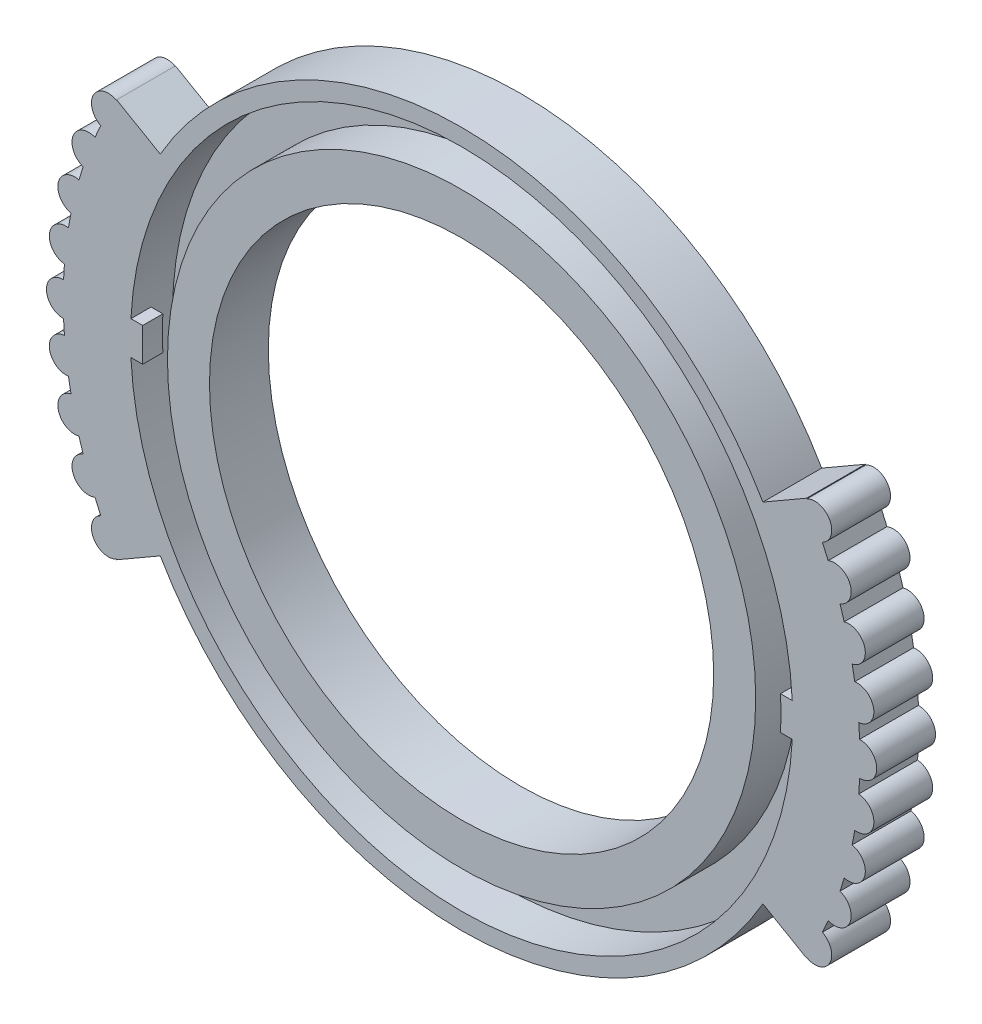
ISO-10303-21;
HEADER;
FILE_DESCRIPTION(('STEP AP214'),'2;1');
FILE_NAME('part.step','',(''),(''),'','','');
FILE_SCHEMA(('AUTOMOTIVE_DESIGN { 1 0 10303 214 1 1 1 1 }'));
ENDSEC;
DATA;
#1=APPLICATION_CONTEXT('core data for automotive mechanical design processes');
#2=APPLICATION_PROTOCOL_DEFINITION('international standard','automotive_design',2000,#1);
#3=PRODUCT_CONTEXT('',#1,'mechanical');
#4=PRODUCT('Part','Part','',(#3));
#5=PRODUCT_RELATED_PRODUCT_CATEGORY('part','',(#4));
#6=PRODUCT_DEFINITION_FORMATION('','',#4);
#7=PRODUCT_DEFINITION_CONTEXT('part definition',#1,'design');
#8=PRODUCT_DEFINITION('design','',#6,#7);
#9=PRODUCT_DEFINITION_SHAPE('','',#8);
#10=(LENGTH_UNIT() NAMED_UNIT(*) SI_UNIT(.MILLI.,.METRE.));
#11=(NAMED_UNIT(*) PLANE_ANGLE_UNIT() SI_UNIT($,.RADIAN.));
#12=(NAMED_UNIT(*) SI_UNIT($,.STERADIAN.) SOLID_ANGLE_UNIT());
#13=UNCERTAINTY_MEASURE_WITH_UNIT(LENGTH_MEASURE(1.E-05),#10,'distance_accuracy_value','');
#14=(GEOMETRIC_REPRESENTATION_CONTEXT(3) GLOBAL_UNCERTAINTY_ASSIGNED_CONTEXT((#13)) GLOBAL_UNIT_ASSIGNED_CONTEXT((#10,
#11,#12)) REPRESENTATION_CONTEXT('',''));
#15=CARTESIAN_POINT('',(0.,0.,0.));
#16=DIRECTION('',(0.,0.,1.));
#17=DIRECTION('',(1.,0.,0.));
#18=AXIS2_PLACEMENT_3D('',#15,#16,#17);
#19=CARTESIAN_POINT('',(25.,-30.,-37.3));
#20=DIRECTION('',(0.,0.,1.));
#21=DIRECTION('',(1.,0.,0.));
#22=AXIS2_PLACEMENT_3D('',#19,#20,#21);
#23=CYLINDRICAL_SURFACE('',#22,23.7);
#24=DIRECTION('',(0.,0.,-1.));
#25=VECTOR('',#24,1.);
#26=CARTESIAN_POINT('',(1.37167923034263,-28.1581374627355,-35.55));
#27=LINE('',#26,#25);
#28=CARTESIAN_POINT('',(1.37167923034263,-28.1581374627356,-37.3));
#29=VERTEX_POINT('',#28);
#30=CARTESIAN_POINT('',(1.37167923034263,-28.1581374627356,-33.8));
#31=VERTEX_POINT('',#30);
#32=EDGE_CURVE('E11',#29,#31,#27,.F.);
#33=ORIENTED_EDGE('',*,*,#32,.F.);
#34=CARTESIAN_POINT('',(25.,-30.,-37.3));
#35=DIRECTION('',(0.,0.,-1.));
#36=DIRECTION('',(-1.,0.,0.));
#37=AXIS2_PLACEMENT_3D('',#34,#35,#36);
#38=CIRCLE('',#37,23.7);
#39=CARTESIAN_POINT('',(1.32109704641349,-29.0002225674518,-37.3));
#40=VERTEX_POINT('',#39);
#41=EDGE_CURVE('E24',#40,#29,#38,.T.);
#42=ORIENTED_EDGE('',*,*,#41,.F.);
#43=DIRECTION('',(0.,0.,-1.));
#44=VECTOR('',#43,1.);
#45=CARTESIAN_POINT('',(1.32109704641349,-29.0002225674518,-35.55));
#46=LINE('',#45,#44);
#47=CARTESIAN_POINT('',(1.32109704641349,-29.0002225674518,-33.8));
#48=VERTEX_POINT('',#47);
#49=EDGE_CURVE('E712',#48,#40,#46,.T.);
#50=ORIENTED_EDGE('',*,*,#49,.F.);
#51=CARTESIAN_POINT('',(25.,-30.,-33.8));
#52=DIRECTION('',(0.,0.,-1.));
#53=DIRECTION('',(-1.,0.,0.));
#54=AXIS2_PLACEMENT_3D('',#51,#52,#53);
#55=CIRCLE('',#54,23.7);
#56=EDGE_CURVE('E710',#48,#31,#55,.T.);
#57=ORIENTED_EDGE('',*,*,#56,.T.);
#58=EDGE_LOOP('',(#33,#42,#50,#57));
#59=FACE_BOUND('',#58,.T.);
#60=ADVANCED_FACE('F16',(#59),#23,.T.);
#61=DIRECTION('',(0.,0.,-1.));
#62=VECTOR('',#61,1.);
#63=CARTESIAN_POINT('',(1.61103325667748,-26.1729600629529,-35.55));
#64=LINE('',#63,#62);
#65=CARTESIAN_POINT('',(1.61103325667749,-26.1729600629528,-33.8));
#66=VERTEX_POINT('',#65);
#67=CARTESIAN_POINT('',(1.61103325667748,-26.1729600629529,-37.3));
#68=VERTEX_POINT('',#67);
#69=EDGE_CURVE('E707',#66,#68,#64,.T.);
#70=ORIENTED_EDGE('',*,*,#69,.F.);
#71=CARTESIAN_POINT('',(1.76205240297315,-25.3429847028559,-33.8));
#72=VERTEX_POINT('',#71);
#73=EDGE_CURVE('E705',#66,#72,#55,.T.);
#74=ORIENTED_EDGE('',*,*,#73,.T.);
#75=DIRECTION('',(0.,0.,-1.));
#76=VECTOR('',#75,1.);
#77=CARTESIAN_POINT('',(1.76205240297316,-25.3429847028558,-35.55));
#78=LINE('',#77,#76);
#79=CARTESIAN_POINT('',(1.76205240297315,-25.3429847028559,-37.3));
#80=VERTEX_POINT('',#79);
#81=EDGE_CURVE('E702',#80,#72,#78,.F.);
#82=ORIENTED_EDGE('',*,*,#81,.F.);
#83=EDGE_CURVE('E706',#68,#80,#38,.T.);
#84=ORIENTED_EDGE('',*,*,#83,.F.);
#85=EDGE_LOOP('',(#70,#74,#82,#84));
#86=FACE_BOUND('',#85,.T.);
#87=ADVANCED_FACE('F805',(#86),#23,.T.);
#88=CARTESIAN_POINT('',(4.47519793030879,-41.85,-33.8));
#89=VERTEX_POINT('',#88);
#90=CARTESIAN_POINT('',(4.45820240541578,-41.8205140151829,-33.8));
#91=VERTEX_POINT('',#90);
#92=EDGE_CURVE('E701',#89,#91,#55,.T.);
#93=ORIENTED_EDGE('',*,*,#92,.T.);
#94=DIRECTION('',(0.,0.,-1.));
#95=VECTOR('',#94,1.);
#96=CARTESIAN_POINT('',(4.45820240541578,-41.8205140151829,-35.55));
#97=LINE('',#96,#95);
#98=CARTESIAN_POINT('',(4.45820240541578,-41.8205140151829,-37.3));
#99=VERTEX_POINT('',#98);
#100=EDGE_CURVE('E699',#91,#99,#97,.T.);
#101=ORIENTED_EDGE('',*,*,#100,.T.);
#102=CARTESIAN_POINT('',(4.47519793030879,-41.85,-37.3));
#103=VERTEX_POINT('',#102);
#104=EDGE_CURVE('E698',#103,#99,#38,.T.);
#105=ORIENTED_EDGE('',*,*,#104,.F.);
#106=DIRECTION('',(0.,0.,1.));
#107=VECTOR('',#106,1.);
#108=CARTESIAN_POINT('',(4.47519793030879,-41.85,-176.545034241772));
#109=LINE('',#108,#107);
#110=EDGE_CURVE('E696',#103,#89,#109,.T.);
#111=ORIENTED_EDGE('',*,*,#110,.T.);
#112=EDGE_LOOP('',(#93,#101,#105,#111));
#113=FACE_BOUND('',#112,.T.);
#114=ADVANCED_FACE('F809',(#113),#23,.T.);
#115=CARTESIAN_POINT('',(3.53491071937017,-40.0468871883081,-37.3));
#116=VERTEX_POINT('',#115);
#117=CARTESIAN_POINT('',(3.19094603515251,-39.2765923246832,-37.3));
#118=VERTEX_POINT('',#117);
#119=EDGE_CURVE('E695',#116,#118,#38,.T.);
#120=ORIENTED_EDGE('',*,*,#119,.F.);
#121=DIRECTION('',(0.,0.,-1.));
#122=VECTOR('',#121,1.);
#123=CARTESIAN_POINT('',(3.53491071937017,-40.0468871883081,-35.55));
#124=LINE('',#123,#122);
#125=CARTESIAN_POINT('',(3.53491071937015,-40.0468871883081,-33.8));
#126=VERTEX_POINT('',#125);
#127=EDGE_CURVE('E693',#116,#126,#124,.F.);
#128=ORIENTED_EDGE('',*,*,#127,.T.);
#129=CARTESIAN_POINT('',(3.19094603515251,-39.2765923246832,-33.8));
#130=VERTEX_POINT('',#129);
#131=EDGE_CURVE('E692',#126,#130,#55,.T.);
#132=ORIENTED_EDGE('',*,*,#131,.T.);
#133=DIRECTION('',(0.,0.,-1.));
#134=VECTOR('',#133,1.);
#135=CARTESIAN_POINT('',(3.19094603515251,-39.2765923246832,-35.55));
#136=LINE('',#135,#134);
#137=EDGE_CURVE('E690',#130,#118,#136,.T.);
#138=ORIENTED_EDGE('',*,*,#137,.T.);
#139=EDGE_LOOP('',(#120,#128,#132,#138));
#140=FACE_BOUND('',#139,.T.);
#141=ADVANCED_FACE('F1431',(#140),#23,.T.);
#142=CARTESIAN_POINT('',(2.48660273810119,-37.405197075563,-37.3));
#143=VERTEX_POINT('',#142);
#144=CARTESIAN_POINT('',(2.23731838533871,-36.599267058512,-37.3));
#145=VERTEX_POINT('',#144);
#146=EDGE_CURVE('E689',#143,#145,#38,.T.);
#147=ORIENTED_EDGE('',*,*,#146,.F.);
#148=DIRECTION('',(0.,0.,-1.));
#149=VECTOR('',#148,1.);
#150=CARTESIAN_POINT('',(2.48660273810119,-37.405197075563,-35.55));
#151=LINE('',#150,#149);
#152=CARTESIAN_POINT('',(2.48660273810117,-37.405197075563,-33.8));
#153=VERTEX_POINT('',#152);
#154=EDGE_CURVE('E687',#143,#153,#151,.F.);
#155=ORIENTED_EDGE('',*,*,#154,.T.);
#156=CARTESIAN_POINT('',(2.23731838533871,-36.599267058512,-33.8));
#157=VERTEX_POINT('',#156);
#158=EDGE_CURVE('E686',#153,#157,#55,.T.);
#159=ORIENTED_EDGE('',*,*,#158,.T.);
#160=DIRECTION('',(0.,0.,-1.));
#161=VECTOR('',#160,1.);
#162=CARTESIAN_POINT('',(2.23731838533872,-36.599267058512,-35.55));
#163=LINE('',#162,#161);
#164=EDGE_CURVE('E684',#157,#145,#163,.T.);
#165=ORIENTED_EDGE('',*,*,#164,.T.);
#166=EDGE_LOOP('',(#147,#155,#159,#165));
#167=FACE_BOUND('',#166,.T.);
#168=ADVANCED_FACE('F786',(#167),#23,.T.);
#169=CARTESIAN_POINT('',(1.76205240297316,-34.6570152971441,-37.3));
#170=VERTEX_POINT('',#169);
#171=CARTESIAN_POINT('',(1.61103325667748,-33.8270399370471,-37.3));
#172=VERTEX_POINT('',#171);
#173=EDGE_CURVE('E683',#170,#172,#38,.T.);
#174=ORIENTED_EDGE('',*,*,#173,.F.);
#175=DIRECTION('',(0.,0.,-1.));
#176=VECTOR('',#175,1.);
#177=CARTESIAN_POINT('',(1.76205240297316,-34.6570152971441,-35.55));
#178=LINE('',#177,#176);
#179=CARTESIAN_POINT('',(1.76205240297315,-34.6570152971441,-33.8));
#180=VERTEX_POINT('',#179);
#181=EDGE_CURVE('E681',#170,#180,#178,.F.);
#182=ORIENTED_EDGE('',*,*,#181,.T.);
#183=CARTESIAN_POINT('',(1.61103325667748,-33.8270399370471,-33.8));
#184=VERTEX_POINT('',#183);
#185=EDGE_CURVE('E680',#180,#184,#55,.T.);
#186=ORIENTED_EDGE('',*,*,#185,.T.);
#187=DIRECTION('',(0.,0.,-1.));
#188=VECTOR('',#187,1.);
#189=CARTESIAN_POINT('',(1.61103325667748,-33.8270399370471,-35.55));
#190=LINE('',#189,#188);
#191=EDGE_CURVE('E678',#184,#172,#190,.T.);
#192=ORIENTED_EDGE('',*,*,#191,.T.);
#193=EDGE_LOOP('',(#174,#182,#186,#192));
#194=FACE_BOUND('',#193,.T.);
#195=ADVANCED_FACE('F781',(#194),#23,.T.);
#196=CARTESIAN_POINT('',(1.37167923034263,-31.8418625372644,-37.3));
#197=VERTEX_POINT('',#196);
#198=CARTESIAN_POINT('',(1.32109704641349,-30.9997774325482,-37.3));
#199=VERTEX_POINT('',#198);
#200=EDGE_CURVE('E677',#197,#199,#38,.T.);
#201=ORIENTED_EDGE('',*,*,#200,.F.);
#202=DIRECTION('',(0.,0.,-1.));
#203=VECTOR('',#202,1.);
#204=CARTESIAN_POINT('',(1.37167923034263,-31.8418625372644,-35.55));
#205=LINE('',#204,#203);
#206=CARTESIAN_POINT('',(1.37167923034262,-31.8418625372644,-33.8));
#207=VERTEX_POINT('',#206);
#208=EDGE_CURVE('E675',#197,#207,#205,.F.);
#209=ORIENTED_EDGE('',*,*,#208,.T.);
#210=CARTESIAN_POINT('',(1.32109704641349,-30.9997774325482,-33.8));
#211=VERTEX_POINT('',#210);
#212=EDGE_CURVE('E674',#207,#211,#55,.T.);
#213=ORIENTED_EDGE('',*,*,#212,.T.);
#214=DIRECTION('',(0.,0.,-1.));
#215=VECTOR('',#214,1.);
#216=CARTESIAN_POINT('',(1.32109704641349,-30.9997774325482,-35.55));
#217=LINE('',#216,#215);
#218=EDGE_CURVE('E671',#199,#211,#217,.F.);
#219=ORIENTED_EDGE('',*,*,#218,.F.);
#220=EDGE_LOOP('',(#201,#209,#213,#219));
#221=FACE_BOUND('',#220,.T.);
#222=ADVANCED_FACE('F1409',(#221),#23,.T.);
#223=DIRECTION('',(0.,0.,-1.));
#224=VECTOR('',#223,1.);
#225=CARTESIAN_POINT('',(2.23731838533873,-23.400732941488,-35.55));
#226=LINE('',#225,#224);
#227=CARTESIAN_POINT('',(2.23731838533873,-23.400732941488,-33.8));
#228=VERTEX_POINT('',#227);
#229=CARTESIAN_POINT('',(2.23731838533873,-23.400732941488,-37.3));
#230=VERTEX_POINT('',#229);
#231=EDGE_CURVE('E668',#228,#230,#226,.T.);
#232=ORIENTED_EDGE('',*,*,#231,.F.);
#233=CARTESIAN_POINT('',(2.48660273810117,-22.594802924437,-33.8));
#234=VERTEX_POINT('',#233);
#235=EDGE_CURVE('E667',#228,#234,#55,.T.);
#236=ORIENTED_EDGE('',*,*,#235,.T.);
#237=DIRECTION('',(0.,0.,-1.));
#238=VECTOR('',#237,1.);
#239=CARTESIAN_POINT('',(2.48660273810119,-22.594802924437,-35.55));
#240=LINE('',#239,#238);
#241=CARTESIAN_POINT('',(2.48660273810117,-22.594802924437,-37.3));
#242=VERTEX_POINT('',#241);
#243=EDGE_CURVE('E664',#242,#234,#240,.F.);
#244=ORIENTED_EDGE('',*,*,#243,.F.);
#245=EDGE_CURVE('E663',#230,#242,#38,.T.);
#246=ORIENTED_EDGE('',*,*,#245,.F.);
#247=EDGE_LOOP('',(#232,#236,#244,#246));
#248=FACE_BOUND('',#247,.T.);
#249=ADVANCED_FACE('F860',(#248),#23,.T.);
#250=DIRECTION('',(0.,0.,-1.));
#251=VECTOR('',#250,1.);
#252=CARTESIAN_POINT('',(3.19094603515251,-20.7234076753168,-35.55));
#253=LINE('',#252,#251);
#254=CARTESIAN_POINT('',(3.19094603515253,-20.7234076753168,-33.8));
#255=VERTEX_POINT('',#254);
#256=CARTESIAN_POINT('',(3.19094603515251,-20.7234076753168,-37.3));
#257=VERTEX_POINT('',#256);
#258=EDGE_CURVE('E660',#255,#257,#253,.T.);
#259=ORIENTED_EDGE('',*,*,#258,.F.);
#260=CARTESIAN_POINT('',(3.53491071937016,-19.9531128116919,-33.8));
#261=VERTEX_POINT('',#260);
#262=EDGE_CURVE('E659',#255,#261,#55,.T.);
#263=ORIENTED_EDGE('',*,*,#262,.T.);
#264=DIRECTION('',(0.,0.,-1.));
#265=VECTOR('',#264,1.);
#266=CARTESIAN_POINT('',(3.53491071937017,-19.9531128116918,-35.55));
#267=LINE('',#266,#265);
#268=CARTESIAN_POINT('',(3.53491071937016,-19.9531128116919,-37.3));
#269=VERTEX_POINT('',#268);
#270=EDGE_CURVE('E656',#269,#261,#267,.F.);
#271=ORIENTED_EDGE('',*,*,#270,.F.);
#272=EDGE_CURVE('E655',#257,#269,#38,.T.);
#273=ORIENTED_EDGE('',*,*,#272,.F.);
#274=EDGE_LOOP('',(#259,#263,#271,#273));
#275=FACE_BOUND('',#274,.T.);
#276=ADVANCED_FACE('F863',(#275),#23,.T.);
#277=DIRECTION('',(0.,0.,-1.));
#278=VECTOR('',#277,1.);
#279=CARTESIAN_POINT('',(4.45820240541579,-18.1794859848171,-35.55));
#280=LINE('',#279,#278);
#281=CARTESIAN_POINT('',(4.4582024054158,-18.1794859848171,-33.8));
#282=VERTEX_POINT('',#281);
#283=CARTESIAN_POINT('',(4.45820240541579,-18.1794859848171,-37.3));
#284=VERTEX_POINT('',#283);
#285=EDGE_CURVE('E652',#282,#284,#280,.T.);
#286=ORIENTED_EDGE('',*,*,#285,.F.);
#287=CARTESIAN_POINT('',(4.4751979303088,-18.15,-33.8));
#288=VERTEX_POINT('',#287);
#289=EDGE_CURVE('E651',#282,#288,#55,.T.);
#290=ORIENTED_EDGE('',*,*,#289,.T.);
#291=DIRECTION('',(0.,0.,1.));
#292=VECTOR('',#291,1.);
#293=CARTESIAN_POINT('',(4.4751979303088,-18.15,-176.545034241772));
#294=LINE('',#293,#292);
#295=CARTESIAN_POINT('',(4.4751979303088,-18.15,-37.3));
#296=VERTEX_POINT('',#295);
#297=EDGE_CURVE('E648',#296,#288,#294,.T.);
#298=ORIENTED_EDGE('',*,*,#297,.F.);
#299=EDGE_CURVE('E647',#284,#296,#38,.T.);
#300=ORIENTED_EDGE('',*,*,#299,.F.);
#301=EDGE_LOOP('',(#286,#290,#298,#300));
#302=FACE_BOUND('',#301,.T.);
#303=ADVANCED_FACE('F866',(#302),#23,.T.);
#304=DIRECTION('',(0.,0.,-1.));
#305=VECTOR('',#304,1.);
#306=CARTESIAN_POINT('',(46.4650892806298,-40.0468871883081,-35.55));
#307=LINE('',#306,#305);
#308=CARTESIAN_POINT('',(46.4650892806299,-40.0468871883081,-37.3));
#309=VERTEX_POINT('',#308);
#310=CARTESIAN_POINT('',(46.4650892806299,-40.0468871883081,-33.8));
#311=VERTEX_POINT('',#310);
#312=EDGE_CURVE('E644',#309,#311,#307,.F.);
#313=ORIENTED_EDGE('',*,*,#312,.F.);
#314=CARTESIAN_POINT('',(46.8090539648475,-39.2765923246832,-37.3));
#315=VERTEX_POINT('',#314);
#316=EDGE_CURVE('E643',#315,#309,#38,.T.);
#317=ORIENTED_EDGE('',*,*,#316,.F.);
#318=DIRECTION('',(0.,0.,-1.));
#319=VECTOR('',#318,1.);
#320=CARTESIAN_POINT('',(46.8090539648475,-39.2765923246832,-35.55));
#321=LINE('',#320,#319);
#322=CARTESIAN_POINT('',(46.8090539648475,-39.2765923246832,-33.8));
#323=VERTEX_POINT('',#322);
#324=EDGE_CURVE('E640',#323,#315,#321,.T.);
#325=ORIENTED_EDGE('',*,*,#324,.F.);
#326=EDGE_CURVE('E639',#323,#311,#55,.T.);
#327=ORIENTED_EDGE('',*,*,#326,.T.);
#328=EDGE_LOOP('',(#313,#317,#325,#327));
#329=FACE_BOUND('',#328,.T.);
#330=ADVANCED_FACE('F1380',(#329),#23,.T.);
#331=DIRECTION('',(0.,0.,-1.));
#332=VECTOR('',#331,1.);
#333=CARTESIAN_POINT('',(45.5417975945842,-41.8205140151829,-35.55));
#334=LINE('',#333,#332);
#335=CARTESIAN_POINT('',(45.5417975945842,-41.8205140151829,-33.8));
#336=VERTEX_POINT('',#335);
#337=CARTESIAN_POINT('',(45.5417975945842,-41.8205140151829,-37.3));
#338=VERTEX_POINT('',#337);
#339=EDGE_CURVE('E636',#336,#338,#334,.T.);
#340=ORIENTED_EDGE('',*,*,#339,.F.);
#341=CARTESIAN_POINT('',(45.5248020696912,-41.85,-33.8));
#342=VERTEX_POINT('',#341);
#343=EDGE_CURVE('E635',#336,#342,#55,.T.);
#344=ORIENTED_EDGE('',*,*,#343,.T.);
#345=DIRECTION('',(0.,0.,1.));
#346=VECTOR('',#345,1.);
#347=CARTESIAN_POINT('',(45.5248020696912,-41.85,-176.545034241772));
#348=LINE('',#347,#346);
#349=CARTESIAN_POINT('',(45.5248020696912,-41.85,-37.3));
#350=VERTEX_POINT('',#349);
#351=EDGE_CURVE('E632',#350,#342,#348,.T.);
#352=ORIENTED_EDGE('',*,*,#351,.F.);
#353=EDGE_CURVE('E631',#338,#350,#38,.T.);
#354=ORIENTED_EDGE('',*,*,#353,.F.);
#355=EDGE_LOOP('',(#340,#344,#352,#354));
#356=FACE_BOUND('',#355,.T.);
#357=ADVANCED_FACE('F1372',(#356),#23,.T.);
#358=DIRECTION('',(0.,0.,-1.));
#359=VECTOR('',#358,1.);
#360=CARTESIAN_POINT('',(47.5133972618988,-37.405197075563,-35.55));
#361=LINE('',#360,#359);
#362=CARTESIAN_POINT('',(47.5133972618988,-37.405197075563,-37.3));
#363=VERTEX_POINT('',#362);
#364=CARTESIAN_POINT('',(47.5133972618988,-37.405197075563,-33.8));
#365=VERTEX_POINT('',#364);
#366=EDGE_CURVE('E628',#363,#365,#361,.F.);
#367=ORIENTED_EDGE('',*,*,#366,.F.);
#368=CARTESIAN_POINT('',(47.7626816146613,-36.599267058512,-37.3));
#369=VERTEX_POINT('',#368);
#370=EDGE_CURVE('E627',#369,#363,#38,.T.);
#371=ORIENTED_EDGE('',*,*,#370,.F.);
#372=DIRECTION('',(0.,0.,-1.));
#373=VECTOR('',#372,1.);
#374=CARTESIAN_POINT('',(47.7626816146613,-36.599267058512,-35.55));
#375=LINE('',#374,#373);
#376=CARTESIAN_POINT('',(47.7626816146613,-36.599267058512,-33.8));
#377=VERTEX_POINT('',#376);
#378=EDGE_CURVE('E624',#377,#369,#375,.T.);
#379=ORIENTED_EDGE('',*,*,#378,.F.);
#380=EDGE_CURVE('E623',#377,#365,#55,.T.);
#381=ORIENTED_EDGE('',*,*,#380,.T.);
#382=EDGE_LOOP('',(#367,#371,#379,#381));
#383=FACE_BOUND('',#382,.T.);
#384=ADVANCED_FACE('F1364',(#383),#23,.T.);
#385=DIRECTION('',(0.,0.,-1.));
#386=VECTOR('',#385,1.);
#387=CARTESIAN_POINT('',(48.2379475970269,-34.6570152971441,-35.55));
#388=LINE('',#387,#386);
#389=CARTESIAN_POINT('',(48.2379475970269,-34.6570152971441,-37.3));
#390=VERTEX_POINT('',#389);
#391=CARTESIAN_POINT('',(48.2379475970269,-34.6570152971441,-33.8));
#392=VERTEX_POINT('',#391);
#393=EDGE_CURVE('E620',#390,#392,#388,.F.);
#394=ORIENTED_EDGE('',*,*,#393,.F.);
#395=CARTESIAN_POINT('',(48.3889667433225,-33.8270399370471,-37.3));
#396=VERTEX_POINT('',#395);
#397=EDGE_CURVE('E619',#396,#390,#38,.T.);
#398=ORIENTED_EDGE('',*,*,#397,.F.);
#399=DIRECTION('',(0.,0.,-1.));
#400=VECTOR('',#399,1.);
#401=CARTESIAN_POINT('',(48.3889667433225,-33.8270399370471,-35.55));
#402=LINE('',#401,#400);
#403=CARTESIAN_POINT('',(48.3889667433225,-33.8270399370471,-33.8));
#404=VERTEX_POINT('',#403);
#405=EDGE_CURVE('E616',#404,#396,#402,.T.);
#406=ORIENTED_EDGE('',*,*,#405,.F.);
#407=EDGE_CURVE('E615',#404,#392,#55,.T.);
#408=ORIENTED_EDGE('',*,*,#407,.T.);
#409=EDGE_LOOP('',(#394,#398,#406,#408));
#410=FACE_BOUND('',#409,.T.);
#411=ADVANCED_FACE('F842',(#410),#23,.T.);
#412=DIRECTION('',(0.,0.,-1.));
#413=VECTOR('',#412,1.);
#414=CARTESIAN_POINT('',(48.6283207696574,-31.8418625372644,-35.55));
#415=LINE('',#414,#413);
#416=CARTESIAN_POINT('',(48.6283207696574,-31.8418625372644,-37.3));
#417=VERTEX_POINT('',#416);
#418=CARTESIAN_POINT('',(48.6283207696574,-31.8418625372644,-33.8));
#419=VERTEX_POINT('',#418);
#420=EDGE_CURVE('E612',#417,#419,#415,.F.);
#421=ORIENTED_EDGE('',*,*,#420,.F.);
#422=CARTESIAN_POINT('',(48.6789029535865,-30.9997774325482,-37.3));
#423=VERTEX_POINT('',#422);
#424=EDGE_CURVE('E610',#423,#417,#38,.T.);
#425=ORIENTED_EDGE('',*,*,#424,.F.);
#426=DIRECTION('',(0.,0.,-1.));
#427=VECTOR('',#426,1.);
#428=CARTESIAN_POINT('',(48.6789029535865,-30.9997774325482,-35.55));
#429=LINE('',#428,#427);
#430=CARTESIAN_POINT('',(48.6789029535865,-30.9997774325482,-33.8));
#431=VERTEX_POINT('',#430);
#432=EDGE_CURVE('E608',#423,#431,#429,.F.);
#433=ORIENTED_EDGE('',*,*,#432,.T.);
#434=EDGE_CURVE('E611',#431,#419,#55,.T.);
#435=ORIENTED_EDGE('',*,*,#434,.T.);
#436=EDGE_LOOP('',(#421,#425,#433,#435));
#437=FACE_BOUND('',#436,.T.);
#438=ADVANCED_FACE('F837',(#437),#23,.T.);
#439=CARTESIAN_POINT('',(45.5248020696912,-18.15,-33.8));
#440=VERTEX_POINT('',#439);
#441=CARTESIAN_POINT('',(45.5417975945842,-18.1794859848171,-33.8));
#442=VERTEX_POINT('',#441);
#443=EDGE_CURVE('E607',#440,#442,#55,.T.);
#444=ORIENTED_EDGE('',*,*,#443,.T.);
#445=DIRECTION('',(0.,0.,-1.));
#446=VECTOR('',#445,1.);
#447=CARTESIAN_POINT('',(45.5417975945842,-18.1794859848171,-35.55));
#448=LINE('',#447,#446);
#449=CARTESIAN_POINT('',(45.5417975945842,-18.1794859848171,-37.3));
#450=VERTEX_POINT('',#449);
#451=EDGE_CURVE('E605',#442,#450,#448,.T.);
#452=ORIENTED_EDGE('',*,*,#451,.T.);
#453=CARTESIAN_POINT('',(45.5248020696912,-18.15,-37.3));
#454=VERTEX_POINT('',#453);
#455=EDGE_CURVE('E604',#454,#450,#38,.T.);
#456=ORIENTED_EDGE('',*,*,#455,.F.);
#457=DIRECTION('',(0.,0.,1.));
#458=VECTOR('',#457,1.);
#459=CARTESIAN_POINT('',(45.5248020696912,-18.15,-176.545034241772));
#460=LINE('',#459,#458);
#461=EDGE_CURVE('E602',#454,#440,#460,.T.);
#462=ORIENTED_EDGE('',*,*,#461,.T.);
#463=EDGE_LOOP('',(#444,#452,#456,#462));
#464=FACE_BOUND('',#463,.T.);
#465=ADVANCED_FACE('F881',(#464),#23,.T.);
#466=CARTESIAN_POINT('',(46.4650892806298,-19.9531128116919,-37.3));
#467=VERTEX_POINT('',#466);
#468=CARTESIAN_POINT('',(46.8090539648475,-20.7234076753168,-37.3));
#469=VERTEX_POINT('',#468);
#470=EDGE_CURVE('E601',#467,#469,#38,.T.);
#471=ORIENTED_EDGE('',*,*,#470,.F.);
#472=DIRECTION('',(0.,0.,-1.));
#473=VECTOR('',#472,1.);
#474=CARTESIAN_POINT('',(46.4650892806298,-19.9531128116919,-35.55));
#475=LINE('',#474,#473);
#476=CARTESIAN_POINT('',(46.4650892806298,-19.9531128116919,-33.8));
#477=VERTEX_POINT('',#476);
#478=EDGE_CURVE('E599',#467,#477,#475,.F.);
#479=ORIENTED_EDGE('',*,*,#478,.T.);
#480=CARTESIAN_POINT('',(46.8090539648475,-20.7234076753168,-33.8));
#481=VERTEX_POINT('',#480);
#482=EDGE_CURVE('E598',#477,#481,#55,.T.);
#483=ORIENTED_EDGE('',*,*,#482,.T.);
#484=DIRECTION('',(0.,0.,-1.));
#485=VECTOR('',#484,1.);
#486=CARTESIAN_POINT('',(46.8090539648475,-20.7234076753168,-35.55));
#487=LINE('',#486,#485);
#488=EDGE_CURVE('E596',#481,#469,#487,.T.);
#489=ORIENTED_EDGE('',*,*,#488,.T.);
#490=EDGE_LOOP('',(#471,#479,#483,#489));
#491=FACE_BOUND('',#490,.T.);
#492=ADVANCED_FACE('F897',(#491),#23,.T.);
#493=CARTESIAN_POINT('',(47.5133972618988,-22.594802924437,-37.3));
#494=VERTEX_POINT('',#493);
#495=CARTESIAN_POINT('',(47.7626816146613,-23.400732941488,-37.3));
#496=VERTEX_POINT('',#495);
#497=EDGE_CURVE('E595',#494,#496,#38,.T.);
#498=ORIENTED_EDGE('',*,*,#497,.F.);
#499=DIRECTION('',(0.,0.,-1.));
#500=VECTOR('',#499,1.);
#501=CARTESIAN_POINT('',(47.5133972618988,-22.594802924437,-35.55));
#502=LINE('',#501,#500);
#503=CARTESIAN_POINT('',(47.5133972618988,-22.594802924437,-33.8));
#504=VERTEX_POINT('',#503);
#505=EDGE_CURVE('E593',#494,#504,#502,.F.);
#506=ORIENTED_EDGE('',*,*,#505,.T.);
#507=CARTESIAN_POINT('',(47.7626816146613,-23.400732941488,-33.8));
#508=VERTEX_POINT('',#507);
#509=EDGE_CURVE('E592',#504,#508,#55,.T.);
#510=ORIENTED_EDGE('',*,*,#509,.T.);
#511=DIRECTION('',(0.,0.,-1.));
#512=VECTOR('',#511,1.);
#513=CARTESIAN_POINT('',(47.7626816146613,-23.400732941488,-35.55));
#514=LINE('',#513,#512);
#515=EDGE_CURVE('E590',#508,#496,#514,.T.);
#516=ORIENTED_EDGE('',*,*,#515,.T.);
#517=EDGE_LOOP('',(#498,#506,#510,#516));
#518=FACE_BOUND('',#517,.T.);
#519=ADVANCED_FACE('F819',(#518),#23,.T.);
#520=CARTESIAN_POINT('',(48.2379475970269,-25.3429847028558,-37.3));
#521=VERTEX_POINT('',#520);
#522=CARTESIAN_POINT('',(48.3889667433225,-26.1729600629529,-37.3));
#523=VERTEX_POINT('',#522);
#524=EDGE_CURVE('E589',#521,#523,#38,.T.);
#525=ORIENTED_EDGE('',*,*,#524,.F.);
#526=DIRECTION('',(0.,0.,-1.));
#527=VECTOR('',#526,1.);
#528=CARTESIAN_POINT('',(48.2379475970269,-25.3429847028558,-35.55));
#529=LINE('',#528,#527);
#530=CARTESIAN_POINT('',(48.2379475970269,-25.3429847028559,-33.8));
#531=VERTEX_POINT('',#530);
#532=EDGE_CURVE('E587',#521,#531,#529,.F.);
#533=ORIENTED_EDGE('',*,*,#532,.T.);
#534=CARTESIAN_POINT('',(48.3889667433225,-26.1729600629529,-33.8));
#535=VERTEX_POINT('',#534);
#536=EDGE_CURVE('E586',#531,#535,#55,.T.);
#537=ORIENTED_EDGE('',*,*,#536,.T.);
#538=DIRECTION('',(0.,0.,-1.));
#539=VECTOR('',#538,1.);
#540=CARTESIAN_POINT('',(48.3889667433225,-26.1729600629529,-35.55));
#541=LINE('',#540,#539);
#542=EDGE_CURVE('E584',#535,#523,#541,.T.);
#543=ORIENTED_EDGE('',*,*,#542,.T.);
#544=EDGE_LOOP('',(#525,#533,#537,#543));
#545=FACE_BOUND('',#544,.T.);
#546=ADVANCED_FACE('F812',(#545),#23,.T.);
#547=CARTESIAN_POINT('',(48.6283207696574,-28.1581374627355,-37.3));
#548=VERTEX_POINT('',#547);
#549=CARTESIAN_POINT('',(48.6789029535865,-29.0002225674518,-37.3));
#550=VERTEX_POINT('',#549);
#551=EDGE_CURVE('E583',#548,#550,#38,.T.);
#552=ORIENTED_EDGE('',*,*,#551,.F.);
#553=DIRECTION('',(0.,0.,-1.));
#554=VECTOR('',#553,1.);
#555=CARTESIAN_POINT('',(48.6283207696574,-28.1581374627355,-35.55));
#556=LINE('',#555,#554);
#557=CARTESIAN_POINT('',(48.6283207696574,-28.1581374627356,-33.8));
#558=VERTEX_POINT('',#557);
#559=EDGE_CURVE('E581',#548,#558,#556,.F.);
#560=ORIENTED_EDGE('',*,*,#559,.T.);
#561=CARTESIAN_POINT('',(48.6789029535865,-29.0002225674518,-33.8));
#562=VERTEX_POINT('',#561);
#563=EDGE_CURVE('E580',#558,#562,#55,.T.);
#564=ORIENTED_EDGE('',*,*,#563,.T.);
#565=DIRECTION('',(0.,0.,-1.));
#566=VECTOR('',#565,1.);
#567=CARTESIAN_POINT('',(48.6789029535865,-29.0002225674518,-35.55));
#568=LINE('',#567,#566);
#569=EDGE_CURVE('E578',#562,#550,#568,.T.);
#570=ORIENTED_EDGE('',*,*,#569,.T.);
#571=EDGE_LOOP('',(#552,#560,#564,#570));
#572=FACE_BOUND('',#571,.T.);
#573=ADVANCED_FACE('F18',(#572),#23,.T.);
#574=CARTESIAN_POINT('',(25.,-30.,-36.3));
#575=DIRECTION('',(0.,0.,1.));
#576=DIRECTION('',(1.,0.,0.));
#577=AXIS2_PLACEMENT_3D('',#574,#575,#576);
#578=CYLINDRICAL_SURFACE('',#577,19.7);
#579=DIRECTION('',(0.,0.,1.));
#580=VECTOR('',#579,1.);
#581=CARTESIAN_POINT('',(5.32539708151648,-29.,-36.3));
#582=LINE('',#581,#580);
#583=CARTESIAN_POINT('',(5.32539708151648,-29.,-35.));
#584=VERTEX_POINT('',#583);
#585=CARTESIAN_POINT('',(5.32539708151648,-29.,-33.8));
#586=VERTEX_POINT('',#585);
#587=EDGE_CURVE('E575',#584,#586,#582,.T.);
#588=ORIENTED_EDGE('',*,*,#587,.F.);
#589=CARTESIAN_POINT('',(25.,-30.,-35.));
#590=DIRECTION('',(0.,0.,1.));
#591=DIRECTION('',(1.,0.,0.));
#592=AXIS2_PLACEMENT_3D('',#589,#590,#591);
#593=CIRCLE('',#592,19.7);
#594=CARTESIAN_POINT('',(5.32539708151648,-31.,-35.));
#595=VERTEX_POINT('',#594);
#596=EDGE_CURVE('E573',#584,#595,#593,.T.);
#597=ORIENTED_EDGE('',*,*,#596,.T.);
#598=DIRECTION('',(0.,0.,1.));
#599=VECTOR('',#598,1.);
#600=CARTESIAN_POINT('',(5.32539708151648,-31.,-36.3));
#601=LINE('',#600,#599);
#602=CARTESIAN_POINT('',(5.32539708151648,-31.,-33.8));
#603=VERTEX_POINT('',#602);
#604=EDGE_CURVE('E363',#595,#603,#601,.T.);
#605=ORIENTED_EDGE('',*,*,#604,.T.);
#606=CARTESIAN_POINT('',(25.,-30.,-33.8));
#607=DIRECTION('',(0.,0.,-1.));
#608=DIRECTION('',(-1.,0.,0.));
#609=AXIS2_PLACEMENT_3D('',#606,#607,#608);
#610=CIRCLE('',#609,19.7);
#611=CARTESIAN_POINT('',(44.6746029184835,-31.,-33.8));
#612=VERTEX_POINT('',#611);
#613=EDGE_CURVE('E570',#603,#612,#610,.F.);
#614=ORIENTED_EDGE('',*,*,#613,.T.);
#615=DIRECTION('',(0.,0.,1.));
#616=VECTOR('',#615,1.);
#617=CARTESIAN_POINT('',(44.6746029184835,-31.,-36.3));
#618=LINE('',#617,#616);
#619=CARTESIAN_POINT('',(44.6746029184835,-31.,-35.));
#620=VERTEX_POINT('',#619);
#621=EDGE_CURVE('E567',#620,#612,#618,.T.);
#622=ORIENTED_EDGE('',*,*,#621,.F.);
#623=CARTESIAN_POINT('',(25.,-30.,-35.));
#624=DIRECTION('',(0.,0.,1.));
#625=DIRECTION('',(1.,0.,0.));
#626=AXIS2_PLACEMENT_3D('',#623,#624,#625);
#627=CIRCLE('',#626,19.7);
#628=CARTESIAN_POINT('',(44.6746029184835,-29.,-35.));
#629=VERTEX_POINT('',#628);
#630=EDGE_CURVE('E565',#620,#629,#627,.T.);
#631=ORIENTED_EDGE('',*,*,#630,.T.);
#632=DIRECTION('',(0.,0.,1.));
#633=VECTOR('',#632,1.);
#634=CARTESIAN_POINT('',(44.6746029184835,-29.,-36.3));
#635=LINE('',#634,#633);
#636=CARTESIAN_POINT('',(44.6746029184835,-29.,-33.8));
#637=VERTEX_POINT('',#636);
#638=EDGE_CURVE('E563',#629,#637,#635,.T.);
#639=ORIENTED_EDGE('',*,*,#638,.T.);
#640=EDGE_CURVE('E562',#637,#586,#610,.F.);
#641=ORIENTED_EDGE('',*,*,#640,.T.);
#642=EDGE_LOOP('',(#588,#597,#605,#614,#622,#631,#639,#641));
#643=FACE_BOUND('',#642,.T.);
#644=CARTESIAN_POINT('',(25.,-30.,-36.3));
#645=DIRECTION('',(0.,0.,-1.));
#646=DIRECTION('',(-1.,0.,0.));
#647=AXIS2_PLACEMENT_3D('',#644,#645,#646);
#648=CIRCLE('',#647,19.7);
#649=CARTESIAN_POINT('',(5.3,-30.,-36.3));
#650=VERTEX_POINT('',#649);
#651=EDGE_CURVE('E559',#650,#650,#648,.T.);
#652=ORIENTED_EDGE('',*,*,#651,.T.);
#653=EDGE_LOOP('',(#652));
#654=FACE_BOUND('',#653,.T.);
#655=ADVANCED_FACE('F811',(#643,#654),#578,.F.);
#656=CARTESIAN_POINT('',(25.,-30.,-37.3));
#657=DIRECTION('',(0.,0.,-1.));
#658=DIRECTION('',(1.,0.,0.));
#659=AXIS2_PLACEMENT_3D('',#656,#657,#658);
#660=PLANE('',#659);
#661=ORIENTED_EDGE('',*,*,#41,.T.);
#662=CARTESIAN_POINT('',(1.47041089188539,-27.1630233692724,-37.3));
#663=DIRECTION('',(0.,0.,1.));
#664=DIRECTION('',(-1.,0.,0.));
#665=AXIS2_PLACEMENT_3D('',#662,#663,#664);
#666=CIRCLE('',#665,1.);
#667=EDGE_CURVE('E556',#68,#29,#666,.T.);
#668=ORIENTED_EDGE('',*,*,#667,.F.);
#669=ORIENTED_EDGE('',*,*,#83,.T.);
#670=CARTESIAN_POINT('',(1.9791929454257,-24.3668443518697,-37.3));
#671=DIRECTION('',(0.,0.,1.));
#672=DIRECTION('',(-1.,0.,0.));
#673=AXIS2_PLACEMENT_3D('',#670,#671,#672);
#674=CIRCLE('',#673,1.);
#675=EDGE_CURVE('E553',#230,#80,#674,.T.);
#676=ORIENTED_EDGE('',*,*,#675,.F.);
#677=ORIENTED_EDGE('',*,*,#245,.T.);
#678=CARTESIAN_POINT('',(2.81902953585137,-21.6516738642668,-37.3));
#679=DIRECTION('',(0.,0.,1.));
#680=DIRECTION('',(-1.,0.,0.));
#681=AXIS2_PLACEMENT_3D('',#678,#679,#680);
#682=CIRCLE('',#681,1.);
#683=EDGE_CURVE('E550',#257,#242,#682,.T.);
#684=ORIENTED_EDGE('',*,*,#683,.F.);
#685=ORIENTED_EDGE('',*,*,#272,.T.);
#686=CARTESIAN_POINT('',(3.97784325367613,-19.0565578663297,-37.3));
#687=DIRECTION('',(0.,0.,1.));
#688=DIRECTION('',(-1.,0.,0.));
#689=AXIS2_PLACEMENT_3D('',#686,#687,#688);
#690=CIRCLE('',#689,1.);
#691=EDGE_CURVE('E547',#284,#269,#690,.T.);
#692=ORIENTED_EDGE('',*,*,#691,.F.);
#693=ORIENTED_EDGE('',*,*,#299,.T.);
#694=DIRECTION('',(0.866025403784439,-0.5,0.));
#695=VECTOR('',#694,1.);
#696=CARTESIAN_POINT('',(25.,-30.,-37.3));
#697=LINE('',#696,#695);
#698=CARTESIAN_POINT('',(7.07327414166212,-19.65,-37.3));
#699=VERTEX_POINT('',#698);
#700=EDGE_CURVE('E545',#296,#699,#697,.T.);
#701=ORIENTED_EDGE('',*,*,#700,.T.);
#702=CARTESIAN_POINT('',(25.,-30.,-37.3));
#703=DIRECTION('',(0.,0.,-1.));
#704=DIRECTION('',(-1.,0.,0.));
#705=AXIS2_PLACEMENT_3D('',#702,#703,#704);
#706=CIRCLE('',#705,20.7);
#707=CARTESIAN_POINT('',(42.9267258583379,-19.65,-37.3));
#708=VERTEX_POINT('',#707);
#709=EDGE_CURVE('E543',#699,#708,#706,.T.);
#710=ORIENTED_EDGE('',*,*,#709,.T.);
#711=DIRECTION('',(-0.866025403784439,-0.5,0.));
#712=VECTOR('',#711,1.);
#713=CARTESIAN_POINT('',(25.,-30.,-37.3));
#714=LINE('',#713,#712);
#715=EDGE_CURVE('E540',#454,#708,#714,.T.);
#716=ORIENTED_EDGE('',*,*,#715,.F.);
#717=ORIENTED_EDGE('',*,*,#455,.T.);
#718=CARTESIAN_POINT('',(46.0221567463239,-19.0565578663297,-37.3));
#719=DIRECTION('',(0.,0.,-1.));
#720=DIRECTION('',(-1.,0.,0.));
#721=AXIS2_PLACEMENT_3D('',#718,#719,#720);
#722=CIRCLE('',#721,1.);
#723=EDGE_CURVE('E537',#450,#467,#722,.T.);
#724=ORIENTED_EDGE('',*,*,#723,.T.);
#725=ORIENTED_EDGE('',*,*,#470,.T.);
#726=CARTESIAN_POINT('',(47.1809704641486,-21.6516738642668,-37.3));
#727=DIRECTION('',(0.,0.,-1.));
#728=DIRECTION('',(-1.,0.,0.));
#729=AXIS2_PLACEMENT_3D('',#726,#727,#728);
#730=CIRCLE('',#729,1.);
#731=EDGE_CURVE('E534',#469,#494,#730,.T.);
#732=ORIENTED_EDGE('',*,*,#731,.T.);
#733=ORIENTED_EDGE('',*,*,#497,.T.);
#734=CARTESIAN_POINT('',(48.0208070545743,-24.3668443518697,-37.3));
#735=DIRECTION('',(0.,0.,-1.));
#736=DIRECTION('',(-1.,0.,0.));
#737=AXIS2_PLACEMENT_3D('',#734,#735,#736);
#738=CIRCLE('',#737,1.);
#739=EDGE_CURVE('E531',#496,#521,#738,.T.);
#740=ORIENTED_EDGE('',*,*,#739,.T.);
#741=ORIENTED_EDGE('',*,*,#524,.T.);
#742=CARTESIAN_POINT('',(48.5295891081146,-27.1630233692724,-37.3));
#743=DIRECTION('',(0.,0.,-1.));
#744=DIRECTION('',(-1.,0.,0.));
#745=AXIS2_PLACEMENT_3D('',#742,#743,#744);
#746=CIRCLE('',#745,1.);
#747=EDGE_CURVE('E528',#523,#548,#746,.T.);
#748=ORIENTED_EDGE('',*,*,#747,.T.);
#749=ORIENTED_EDGE('',*,*,#551,.T.);
#750=CARTESIAN_POINT('',(48.7,-30.,-37.3));
#751=DIRECTION('',(0.,0.,-1.));
#752=DIRECTION('',(-1.,0.,0.));
#753=AXIS2_PLACEMENT_3D('',#750,#751,#752);
#754=CIRCLE('',#753,1.);
#755=EDGE_CURVE('E525',#550,#423,#754,.T.);
#756=ORIENTED_EDGE('',*,*,#755,.T.);
#757=ORIENTED_EDGE('',*,*,#424,.T.);
#758=CARTESIAN_POINT('',(48.5295891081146,-32.8369766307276,-37.3));
#759=DIRECTION('',(0.,0.,1.));
#760=DIRECTION('',(-1.,0.,0.));
#761=AXIS2_PLACEMENT_3D('',#758,#759,#760);
#762=CIRCLE('',#761,1.);
#763=EDGE_CURVE('E522',#396,#417,#762,.T.);
#764=ORIENTED_EDGE('',*,*,#763,.F.);
#765=ORIENTED_EDGE('',*,*,#397,.T.);
#766=CARTESIAN_POINT('',(48.0208070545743,-35.6331556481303,-37.3));
#767=DIRECTION('',(0.,0.,1.));
#768=DIRECTION('',(-1.,0.,0.));
#769=AXIS2_PLACEMENT_3D('',#766,#767,#768);
#770=CIRCLE('',#769,1.);
#771=EDGE_CURVE('E519',#369,#390,#770,.T.);
#772=ORIENTED_EDGE('',*,*,#771,.F.);
#773=ORIENTED_EDGE('',*,*,#370,.T.);
#774=CARTESIAN_POINT('',(47.1809704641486,-38.3483261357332,-37.3));
#775=DIRECTION('',(0.,0.,1.));
#776=DIRECTION('',(-1.,0.,0.));
#777=AXIS2_PLACEMENT_3D('',#774,#775,#776);
#778=CIRCLE('',#777,1.);
#779=EDGE_CURVE('E516',#315,#363,#778,.T.);
#780=ORIENTED_EDGE('',*,*,#779,.F.);
#781=ORIENTED_EDGE('',*,*,#316,.T.);
#782=CARTESIAN_POINT('',(46.0221567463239,-40.9434421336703,-37.3));
#783=DIRECTION('',(0.,0.,1.));
#784=DIRECTION('',(-1.,0.,0.));
#785=AXIS2_PLACEMENT_3D('',#782,#783,#784);
#786=CIRCLE('',#785,1.);
#787=EDGE_CURVE('E513',#338,#309,#786,.T.);
#788=ORIENTED_EDGE('',*,*,#787,.F.);
#789=ORIENTED_EDGE('',*,*,#353,.T.);
#790=DIRECTION('',(-0.866025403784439,0.5,0.));
#791=VECTOR('',#790,1.);
#792=CARTESIAN_POINT('',(25.,-30.,-37.3));
#793=LINE('',#792,#791);
#794=CARTESIAN_POINT('',(42.9267258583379,-40.35,-37.3));
#795=VERTEX_POINT('',#794);
#796=EDGE_CURVE('E511',#350,#795,#793,.T.);
#797=ORIENTED_EDGE('',*,*,#796,.T.);
#798=CARTESIAN_POINT('',(25.,-30.,-37.3));
#799=DIRECTION('',(0.,0.,-1.));
#800=DIRECTION('',(-1.,0.,0.));
#801=AXIS2_PLACEMENT_3D('',#798,#799,#800);
#802=CIRCLE('',#801,20.7);
#803=CARTESIAN_POINT('',(7.07327414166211,-40.35,-37.3));
#804=VERTEX_POINT('',#803);
#805=EDGE_CURVE('E509',#795,#804,#802,.T.);
#806=ORIENTED_EDGE('',*,*,#805,.T.);
#807=DIRECTION('',(0.866025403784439,0.5,0.));
#808=VECTOR('',#807,1.);
#809=CARTESIAN_POINT('',(25.,-30.,-37.3));
#810=LINE('',#809,#808);
#811=EDGE_CURVE('E506',#103,#804,#810,.T.);
#812=ORIENTED_EDGE('',*,*,#811,.F.);
#813=ORIENTED_EDGE('',*,*,#104,.T.);
#814=CARTESIAN_POINT('',(3.97784325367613,-40.9434421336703,-37.3));
#815=DIRECTION('',(0.,0.,-1.));
#816=DIRECTION('',(-1.,0.,0.));
#817=AXIS2_PLACEMENT_3D('',#814,#815,#816);
#818=CIRCLE('',#817,1.);
#819=EDGE_CURVE('E503',#99,#116,#818,.T.);
#820=ORIENTED_EDGE('',*,*,#819,.T.);
#821=ORIENTED_EDGE('',*,*,#119,.T.);
#822=CARTESIAN_POINT('',(2.81902953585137,-38.3483261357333,-37.3));
#823=DIRECTION('',(0.,0.,-1.));
#824=DIRECTION('',(-1.,0.,0.));
#825=AXIS2_PLACEMENT_3D('',#822,#823,#824);
#826=CIRCLE('',#825,1.);
#827=EDGE_CURVE('E500',#118,#143,#826,.T.);
#828=ORIENTED_EDGE('',*,*,#827,.T.);
#829=ORIENTED_EDGE('',*,*,#146,.T.);
#830=CARTESIAN_POINT('',(1.97919294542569,-35.6331556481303,-37.3));
#831=DIRECTION('',(0.,0.,-1.));
#832=DIRECTION('',(-1.,0.,0.));
#833=AXIS2_PLACEMENT_3D('',#830,#831,#832);
#834=CIRCLE('',#833,1.);
#835=EDGE_CURVE('E497',#145,#170,#834,.T.);
#836=ORIENTED_EDGE('',*,*,#835,.T.);
#837=ORIENTED_EDGE('',*,*,#173,.T.);
#838=CARTESIAN_POINT('',(1.47041089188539,-32.8369766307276,-37.3));
#839=DIRECTION('',(0.,0.,-1.));
#840=DIRECTION('',(-1.,0.,0.));
#841=AXIS2_PLACEMENT_3D('',#838,#839,#840);
#842=CIRCLE('',#841,1.);
#843=EDGE_CURVE('E494',#172,#197,#842,.T.);
#844=ORIENTED_EDGE('',*,*,#843,.T.);
#845=ORIENTED_EDGE('',*,*,#200,.T.);
#846=CARTESIAN_POINT('',(1.3,-30.,-37.3));
#847=DIRECTION('',(0.,0.,1.));
#848=DIRECTION('',(-1.,0.,0.));
#849=AXIS2_PLACEMENT_3D('',#846,#847,#848);
#850=CIRCLE('',#849,1.);
#851=EDGE_CURVE('E491',#40,#199,#850,.T.);
#852=ORIENTED_EDGE('',*,*,#851,.F.);
#853=EDGE_LOOP('',(#661,#668,#669,#676,#677,#684,#685,#692,#693,#701,#710,#716,#717,#724,#725,
#732,#733,#740,#741,#748,#749,#756,#757,#764,#765,#772,#773,#780,#781,#788,#789,#797,#806,#812,
#813,#820,#821,#828,#829,#836,#837,#844,#845,#852));
#854=FACE_BOUND('',#853,.T.);
#855=CARTESIAN_POINT('',(25.,-30.,-37.3));
#856=DIRECTION('',(0.,0.,-1.));
#857=DIRECTION('',(-1.,0.,0.));
#858=AXIS2_PLACEMENT_3D('',#855,#856,#857);
#859=CIRCLE('',#858,15.);
#860=CARTESIAN_POINT('',(10.,-30.,-37.3));
#861=VERTEX_POINT('',#860);
#862=EDGE_CURVE('E488',#861,#861,#859,.T.);
#863=ORIENTED_EDGE('',*,*,#862,.F.);
#864=EDGE_LOOP('',(#863));
#865=FACE_BOUND('',#864,.T.);
#866=ADVANCED_FACE('F768',(#854,#865),#660,.T.);
#867=CARTESIAN_POINT('',(25.,-30.,-33.8));
#868=DIRECTION('',(0.,0.,-1.));
#869=DIRECTION('',(1.,0.,0.));
#870=AXIS2_PLACEMENT_3D('',#867,#868,#869);
#871=PLANE('',#870);
#872=ORIENTED_EDGE('',*,*,#73,.F.);
#873=CARTESIAN_POINT('',(1.47041089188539,-27.1630233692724,-33.8));
#874=DIRECTION('',(0.,0.,-1.));
#875=DIRECTION('',(-1.,0.,0.));
#876=AXIS2_PLACEMENT_3D('',#873,#874,#875);
#877=CIRCLE('',#876,1.);
#878=EDGE_CURVE('E485',#31,#66,#877,.T.);
#879=ORIENTED_EDGE('',*,*,#878,.F.);
#880=ORIENTED_EDGE('',*,*,#56,.F.);
#881=CARTESIAN_POINT('',(1.3,-30.,-33.8));
#882=DIRECTION('',(0.,0.,-1.));
#883=DIRECTION('',(-1.,0.,0.));
#884=AXIS2_PLACEMENT_3D('',#881,#882,#883);
#885=CIRCLE('',#884,1.);
#886=EDGE_CURVE('E482',#211,#48,#885,.T.);
#887=ORIENTED_EDGE('',*,*,#886,.F.);
#888=ORIENTED_EDGE('',*,*,#212,.F.);
#889=CARTESIAN_POINT('',(1.47041089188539,-32.8369766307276,-33.8));
#890=DIRECTION('',(0.,0.,-1.));
#891=DIRECTION('',(-1.,0.,0.));
#892=AXIS2_PLACEMENT_3D('',#889,#890,#891);
#893=CIRCLE('',#892,1.);
#894=EDGE_CURVE('E479',#207,#184,#893,.F.);
#895=ORIENTED_EDGE('',*,*,#894,.T.);
#896=ORIENTED_EDGE('',*,*,#185,.F.);
#897=CARTESIAN_POINT('',(1.97919294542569,-35.6331556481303,-33.8));
#898=DIRECTION('',(0.,0.,-1.));
#899=DIRECTION('',(-1.,0.,0.));
#900=AXIS2_PLACEMENT_3D('',#897,#898,#899);
#901=CIRCLE('',#900,1.);
#902=EDGE_CURVE('E476',#180,#157,#901,.F.);
#903=ORIENTED_EDGE('',*,*,#902,.T.);
#904=ORIENTED_EDGE('',*,*,#158,.F.);
#905=CARTESIAN_POINT('',(2.81902953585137,-38.3483261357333,-33.8));
#906=DIRECTION('',(0.,0.,-1.));
#907=DIRECTION('',(-1.,0.,0.));
#908=AXIS2_PLACEMENT_3D('',#905,#906,#907);
#909=CIRCLE('',#908,1.);
#910=EDGE_CURVE('E473',#153,#130,#909,.F.);
#911=ORIENTED_EDGE('',*,*,#910,.T.);
#912=ORIENTED_EDGE('',*,*,#131,.F.);
#913=CARTESIAN_POINT('',(3.97784325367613,-40.9434421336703,-33.8));
#914=DIRECTION('',(0.,0.,-1.));
#915=DIRECTION('',(-1.,0.,0.));
#916=AXIS2_PLACEMENT_3D('',#913,#914,#915);
#917=CIRCLE('',#916,1.);
#918=EDGE_CURVE('E470',#126,#91,#917,.F.);
#919=ORIENTED_EDGE('',*,*,#918,.T.);
#920=ORIENTED_EDGE('',*,*,#92,.F.);
#921=DIRECTION('',(-0.866025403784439,-0.5,0.));
#922=VECTOR('',#921,1.);
#923=CARTESIAN_POINT('',(5.77423603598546,-41.1,-33.8));
#924=LINE('',#923,#922);
#925=CARTESIAN_POINT('',(7.07327414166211,-40.35,-33.8));
#926=VERTEX_POINT('',#925);
#927=EDGE_CURVE('E467',#926,#89,#924,.T.);
#928=ORIENTED_EDGE('',*,*,#927,.F.);
#929=CARTESIAN_POINT('',(25.,-30.,-33.8));
#930=DIRECTION('',(0.,0.,1.));
#931=DIRECTION('',(1.,0.,0.));
#932=AXIS2_PLACEMENT_3D('',#929,#930,#931);
#933=CIRCLE('',#932,20.7);
#934=CARTESIAN_POINT('',(42.9267258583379,-40.35,-33.8));
#935=VERTEX_POINT('',#934);
#936=EDGE_CURVE('E465',#926,#935,#933,.T.);
#937=ORIENTED_EDGE('',*,*,#936,.T.);
#938=DIRECTION('',(0.866025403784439,-0.5,0.));
#939=VECTOR('',#938,1.);
#940=CARTESIAN_POINT('',(44.2257639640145,-41.1,-33.8));
#941=LINE('',#940,#939);
#942=EDGE_CURVE('E462',#935,#342,#941,.T.);
#943=ORIENTED_EDGE('',*,*,#942,.T.);
#944=ORIENTED_EDGE('',*,*,#343,.F.);
#945=CARTESIAN_POINT('',(46.0221567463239,-40.9434421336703,-33.8));
#946=DIRECTION('',(0.,0.,-1.));
#947=DIRECTION('',(-1.,0.,0.));
#948=AXIS2_PLACEMENT_3D('',#945,#946,#947);
#949=CIRCLE('',#948,1.);
#950=EDGE_CURVE('E459',#311,#336,#949,.T.);
#951=ORIENTED_EDGE('',*,*,#950,.F.);
#952=ORIENTED_EDGE('',*,*,#326,.F.);
#953=CARTESIAN_POINT('',(47.1809704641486,-38.3483261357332,-33.8));
#954=DIRECTION('',(0.,0.,-1.));
#955=DIRECTION('',(-1.,0.,0.));
#956=AXIS2_PLACEMENT_3D('',#953,#954,#955);
#957=CIRCLE('',#956,1.);
#958=EDGE_CURVE('E456',#365,#323,#957,.T.);
#959=ORIENTED_EDGE('',*,*,#958,.F.);
#960=ORIENTED_EDGE('',*,*,#380,.F.);
#961=CARTESIAN_POINT('',(48.0208070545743,-35.6331556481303,-33.8));
#962=DIRECTION('',(0.,0.,-1.));
#963=DIRECTION('',(-1.,0.,0.));
#964=AXIS2_PLACEMENT_3D('',#961,#962,#963);
#965=CIRCLE('',#964,1.);
#966=EDGE_CURVE('E453',#392,#377,#965,.T.);
#967=ORIENTED_EDGE('',*,*,#966,.F.);
#968=ORIENTED_EDGE('',*,*,#407,.F.);
#969=CARTESIAN_POINT('',(48.5295891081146,-32.8369766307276,-33.8));
#970=DIRECTION('',(0.,0.,-1.));
#971=DIRECTION('',(-1.,0.,0.));
#972=AXIS2_PLACEMENT_3D('',#969,#970,#971);
#973=CIRCLE('',#972,1.);
#974=EDGE_CURVE('E450',#419,#404,#973,.T.);
#975=ORIENTED_EDGE('',*,*,#974,.F.);
#976=ORIENTED_EDGE('',*,*,#434,.F.);
#977=CARTESIAN_POINT('',(48.7,-30.,-33.8));
#978=DIRECTION('',(0.,0.,-1.));
#979=DIRECTION('',(-1.,0.,0.));
#980=AXIS2_PLACEMENT_3D('',#977,#978,#979);
#981=CIRCLE('',#980,1.);
#982=EDGE_CURVE('E447',#431,#562,#981,.F.);
#983=ORIENTED_EDGE('',*,*,#982,.T.);
#984=ORIENTED_EDGE('',*,*,#563,.F.);
#985=CARTESIAN_POINT('',(48.5295891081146,-27.1630233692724,-33.8));
#986=DIRECTION('',(0.,0.,-1.));
#987=DIRECTION('',(-1.,0.,0.));
#988=AXIS2_PLACEMENT_3D('',#985,#986,#987);
#989=CIRCLE('',#988,1.);
#990=EDGE_CURVE('E444',#558,#535,#989,.F.);
#991=ORIENTED_EDGE('',*,*,#990,.T.);
#992=ORIENTED_EDGE('',*,*,#536,.F.);
#993=CARTESIAN_POINT('',(48.0208070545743,-24.3668443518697,-33.8));
#994=DIRECTION('',(0.,0.,-1.));
#995=DIRECTION('',(-1.,0.,0.));
#996=AXIS2_PLACEMENT_3D('',#993,#994,#995);
#997=CIRCLE('',#996,1.);
#998=EDGE_CURVE('E441',#531,#508,#997,.F.);
#999=ORIENTED_EDGE('',*,*,#998,.T.);
#1000=ORIENTED_EDGE('',*,*,#509,.F.);
#1001=CARTESIAN_POINT('',(47.1809704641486,-21.6516738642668,-33.8));
#1002=DIRECTION('',(0.,0.,-1.));
#1003=DIRECTION('',(-1.,0.,0.));
#1004=AXIS2_PLACEMENT_3D('',#1001,#1002,#1003);
#1005=CIRCLE('',#1004,1.);
#1006=EDGE_CURVE('E438',#504,#481,#1005,.F.);
#1007=ORIENTED_EDGE('',*,*,#1006,.T.);
#1008=ORIENTED_EDGE('',*,*,#482,.F.);
#1009=CARTESIAN_POINT('',(46.0221567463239,-19.0565578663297,-33.8));
#1010=DIRECTION('',(0.,0.,-1.));
#1011=DIRECTION('',(-1.,0.,0.));
#1012=AXIS2_PLACEMENT_3D('',#1009,#1010,#1011);
#1013=CIRCLE('',#1012,1.);
#1014=EDGE_CURVE('E435',#477,#442,#1013,.F.);
#1015=ORIENTED_EDGE('',*,*,#1014,.T.);
#1016=ORIENTED_EDGE('',*,*,#443,.F.);
#1017=DIRECTION('',(0.866025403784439,0.5,0.));
#1018=VECTOR('',#1017,1.);
#1019=CARTESIAN_POINT('',(44.2257639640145,-18.9,-33.8));
#1020=LINE('',#1019,#1018);
#1021=CARTESIAN_POINT('',(42.9267258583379,-19.65,-33.8));
#1022=VERTEX_POINT('',#1021);
#1023=EDGE_CURVE('E432',#1022,#440,#1020,.T.);
#1024=ORIENTED_EDGE('',*,*,#1023,.F.);
#1025=CARTESIAN_POINT('',(25.,-30.,-33.8));
#1026=DIRECTION('',(0.,0.,1.));
#1027=DIRECTION('',(1.,0.,0.));
#1028=AXIS2_PLACEMENT_3D('',#1025,#1026,#1027);
#1029=CIRCLE('',#1028,20.7);
#1030=CARTESIAN_POINT('',(7.07327414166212,-19.65,-33.8));
#1031=VERTEX_POINT('',#1030);
#1032=EDGE_CURVE('E430',#1022,#1031,#1029,.T.);
#1033=ORIENTED_EDGE('',*,*,#1032,.T.);
#1034=DIRECTION('',(-0.866025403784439,0.5,0.));
#1035=VECTOR('',#1034,1.);
#1036=CARTESIAN_POINT('',(5.77423603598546,-18.9,-33.8));
#1037=LINE('',#1036,#1035);
#1038=EDGE_CURVE('E427',#1031,#288,#1037,.T.);
#1039=ORIENTED_EDGE('',*,*,#1038,.T.);
#1040=ORIENTED_EDGE('',*,*,#289,.F.);
#1041=CARTESIAN_POINT('',(3.97784325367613,-19.0565578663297,-33.8));
#1042=DIRECTION('',(0.,0.,-1.));
#1043=DIRECTION('',(-1.,0.,0.));
#1044=AXIS2_PLACEMENT_3D('',#1041,#1042,#1043);
#1045=CIRCLE('',#1044,1.);
#1046=EDGE_CURVE('E424',#261,#282,#1045,.T.);
#1047=ORIENTED_EDGE('',*,*,#1046,.F.);
#1048=ORIENTED_EDGE('',*,*,#262,.F.);
#1049=CARTESIAN_POINT('',(2.81902953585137,-21.6516738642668,-33.8));
#1050=DIRECTION('',(0.,0.,-1.));
#1051=DIRECTION('',(-1.,0.,0.));
#1052=AXIS2_PLACEMENT_3D('',#1049,#1050,#1051);
#1053=CIRCLE('',#1052,1.);
#1054=EDGE_CURVE('E421',#234,#255,#1053,.T.);
#1055=ORIENTED_EDGE('',*,*,#1054,.F.);
#1056=ORIENTED_EDGE('',*,*,#235,.F.);
#1057=CARTESIAN_POINT('',(1.9791929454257,-24.3668443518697,-33.8));
#1058=DIRECTION('',(0.,0.,-1.));
#1059=DIRECTION('',(-1.,0.,0.));
#1060=AXIS2_PLACEMENT_3D('',#1057,#1058,#1059);
#1061=CIRCLE('',#1060,1.);
#1062=EDGE_CURVE('E418',#72,#228,#1061,.T.);
#1063=ORIENTED_EDGE('',*,*,#1062,.F.);
#1064=EDGE_LOOP('',(#872,#879,#880,#887,#888,#895,#896,#903,#904,#911,#912,#919,#920,#928,#937,
#943,#944,#951,#952,#959,#960,#967,#968,#975,#976,#983,#984,#991,#992,#999,#1000,#1007,#1008,
#1015,#1016,#1024,#1033,#1039,#1040,#1047,#1048,#1055,#1056,#1063));
#1065=FACE_BOUND('',#1064,.T.);
#1066=ORIENTED_EDGE('',*,*,#613,.F.);
#1067=DIRECTION('',(-1.,0.,0.));
#1068=VECTOR('',#1067,1.);
#1069=CARTESIAN_POINT('',(5.67586556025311,-31.,-33.8));
#1070=LINE('',#1069,#1068);
#1071=CARTESIAN_POINT('',(6.02633403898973,-31.,-33.8));
#1072=VERTEX_POINT('',#1071);
#1073=EDGE_CURVE('E416',#1072,#603,#1070,.T.);
#1074=ORIENTED_EDGE('',*,*,#1073,.F.);
#1075=CARTESIAN_POINT('',(24.9999999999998,-30.,-33.8));
#1076=DIRECTION('',(0.,0.,1.));
#1077=DIRECTION('',(1.,0.,0.));
#1078=AXIS2_PLACEMENT_3D('',#1075,#1076,#1077);
#1079=CIRCLE('',#1078,18.9999999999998);
#1080=CARTESIAN_POINT('',(6.02633403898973,-29.,-33.8));
#1081=VERTEX_POINT('',#1080);
#1082=EDGE_CURVE('E357',#1081,#1072,#1079,.T.);
#1083=ORIENTED_EDGE('',*,*,#1082,.F.);
#1084=DIRECTION('',(-1.,0.,0.));
#1085=VECTOR('',#1084,1.);
#1086=CARTESIAN_POINT('',(5.67586556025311,-29.,-33.8));
#1087=LINE('',#1086,#1085);
#1088=EDGE_CURVE('E412',#1081,#586,#1087,.T.);
#1089=ORIENTED_EDGE('',*,*,#1088,.T.);
#1090=ORIENTED_EDGE('',*,*,#640,.F.);
#1091=DIRECTION('',(1.,0.,0.));
#1092=VECTOR('',#1091,1.);
#1093=CARTESIAN_POINT('',(44.3241344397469,-29.,-33.8));
#1094=LINE('',#1093,#1092);
#1095=CARTESIAN_POINT('',(43.9736659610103,-29.,-33.8));
#1096=VERTEX_POINT('',#1095);
#1097=EDGE_CURVE('E409',#1096,#637,#1094,.T.);
#1098=ORIENTED_EDGE('',*,*,#1097,.F.);
#1099=CARTESIAN_POINT('',(25.0000000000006,-30.,-33.8));
#1100=DIRECTION('',(0.,0.,1.));
#1101=DIRECTION('',(1.,0.,0.));
#1102=AXIS2_PLACEMENT_3D('',#1099,#1100,#1101);
#1103=CIRCLE('',#1102,18.9999999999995);
#1104=CARTESIAN_POINT('',(43.9736659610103,-31.,-33.8));
#1105=VERTEX_POINT('',#1104);
#1106=EDGE_CURVE('E406',#1105,#1096,#1103,.T.);
#1107=ORIENTED_EDGE('',*,*,#1106,.F.);
#1108=DIRECTION('',(1.,0.,0.));
#1109=VECTOR('',#1108,1.);
#1110=CARTESIAN_POINT('',(44.3241344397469,-31.,-33.8));
#1111=LINE('',#1110,#1109);
#1112=EDGE_CURVE('E403',#1105,#612,#1111,.T.);
#1113=ORIENTED_EDGE('',*,*,#1112,.T.);
#1114=EDGE_LOOP('',(#1066,#1074,#1083,#1089,#1090,#1098,#1107,#1113));
#1115=FACE_BOUND('',#1114,.T.);
#1116=ADVANCED_FACE('F764',(#1065,#1115),#871,.F.);
#1117=CARTESIAN_POINT('',(25.,-30.,-33.8));
#1118=DIRECTION('',(0.,0.,-1.));
#1119=DIRECTION('',(-1.,0.,0.));
#1120=AXIS2_PLACEMENT_3D('',#1117,#1118,#1119);
#1121=CIRCLE('',#1120,15.);
#1122=CARTESIAN_POINT('',(10.,-30.,-33.8));
#1123=VERTEX_POINT('',#1122);
#1124=EDGE_CURVE('E400',#1123,#1123,#1121,.T.);
#1125=ORIENTED_EDGE('',*,*,#1124,.T.);
#1126=EDGE_LOOP('',(#1125));
#1127=FACE_BOUND('',#1126,.T.);
#1128=CARTESIAN_POINT('',(25.,-30.,-33.8));
#1129=DIRECTION('',(0.,0.,-1.));
#1130=DIRECTION('',(-1.,0.,0.));
#1131=AXIS2_PLACEMENT_3D('',#1128,#1129,#1130);
#1132=CIRCLE('',#1131,17.5);
#1133=CARTESIAN_POINT('',(7.5,-30.,-33.8));
#1134=VERTEX_POINT('',#1133);
#1135=EDGE_CURVE('E397',#1134,#1134,#1132,.F.);
#1136=ORIENTED_EDGE('',*,*,#1135,.T.);
#1137=EDGE_LOOP('',(#1136));
#1138=FACE_BOUND('',#1137,.T.);
#1139=ADVANCED_FACE('F973',(#1127,#1138),#871,.F.);
#1140=CARTESIAN_POINT('',(25.,-30.,-37.3));
#1141=DIRECTION('',(0.,0.,1.));
#1142=DIRECTION('',(1.,0.,0.));
#1143=AXIS2_PLACEMENT_3D('',#1140,#1141,#1142);
#1144=CYLINDRICAL_SURFACE('',#1143,15.);
#1145=ORIENTED_EDGE('',*,*,#862,.T.);
#1146=EDGE_LOOP('',(#1145));
#1147=FACE_BOUND('',#1146,.T.);
#1148=ORIENTED_EDGE('',*,*,#1124,.F.);
#1149=EDGE_LOOP('',(#1148));
#1150=FACE_BOUND('',#1149,.T.);
#1151=ADVANCED_FACE('F969',(#1147,#1150),#1144,.F.);
#1152=CARTESIAN_POINT('',(25.,-30.,-36.3));
#1153=DIRECTION('',(0.,0.,1.));
#1154=DIRECTION('',(1.,0.,0.));
#1155=AXIS2_PLACEMENT_3D('',#1152,#1153,#1154);
#1156=CYLINDRICAL_SURFACE('',#1155,17.5);
#1157=CARTESIAN_POINT('',(25.,-30.,-36.3));
#1158=DIRECTION('',(0.,0.,-1.));
#1159=DIRECTION('',(-1.,0.,0.));
#1160=AXIS2_PLACEMENT_3D('',#1157,#1158,#1159);
#1161=CIRCLE('',#1160,17.5);
#1162=CARTESIAN_POINT('',(7.5,-30.,-36.3));
#1163=VERTEX_POINT('',#1162);
#1164=EDGE_CURVE('E394',#1163,#1163,#1161,.T.);
#1165=ORIENTED_EDGE('',*,*,#1164,.F.);
#1166=EDGE_LOOP('',(#1165));
#1167=FACE_BOUND('',#1166,.T.);
#1168=ORIENTED_EDGE('',*,*,#1135,.F.);
#1169=EDGE_LOOP('',(#1168));
#1170=FACE_BOUND('',#1169,.T.);
#1171=ADVANCED_FACE('F965',(#1167,#1170),#1156,.T.);
#1172=CARTESIAN_POINT('',(25.,-30.,-36.3));
#1173=DIRECTION('',(0.,0.,-1.));
#1174=DIRECTION('',(1.,0.,0.));
#1175=AXIS2_PLACEMENT_3D('',#1172,#1173,#1174);
#1176=PLANE('',#1175);
#1177=ORIENTED_EDGE('',*,*,#1164,.T.);
#1178=EDGE_LOOP('',(#1177));
#1179=FACE_BOUND('',#1178,.T.);
#1180=ORIENTED_EDGE('',*,*,#651,.F.);
#1181=EDGE_LOOP('',(#1180));
#1182=FACE_BOUND('',#1181,.T.);
#1183=ADVANCED_FACE('F961',(#1179,#1182),#1176,.F.);
#1184=CARTESIAN_POINT('',(44.2257639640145,-41.1,-176.545034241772));
#1185=DIRECTION('',(-0.5,-0.866025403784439,0.));
#1186=DIRECTION('',(0.866025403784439,-0.5,0.));
#1187=AXIS2_PLACEMENT_3D('',#1184,#1185,#1186);
#1188=PLANE('',#1187);
#1189=ORIENTED_EDGE('',*,*,#351,.T.);
#1190=ORIENTED_EDGE('',*,*,#942,.F.);
#1191=DIRECTION('',(0.,0.,1.));
#1192=VECTOR('',#1191,1.);
#1193=CARTESIAN_POINT('',(42.9267258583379,-40.35,-176.545034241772));
#1194=LINE('',#1193,#1192);
#1195=EDGE_CURVE('E391',#795,#935,#1194,.T.);
#1196=ORIENTED_EDGE('',*,*,#1195,.F.);
#1197=ORIENTED_EDGE('',*,*,#796,.F.);
#1198=EDGE_LOOP('',(#1189,#1190,#1196,#1197));
#1199=FACE_BOUND('',#1198,.T.);
#1200=ADVANCED_FACE('F957',(#1199),#1188,.T.);
#1201=CARTESIAN_POINT('',(25.,-30.,-176.545034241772));
#1202=DIRECTION('',(0.,0.,1.));
#1203=DIRECTION('',(1.,0.,0.));
#1204=AXIS2_PLACEMENT_3D('',#1201,#1202,#1203);
#1205=CYLINDRICAL_SURFACE('',#1204,20.7);
#1206=ORIENTED_EDGE('',*,*,#1195,.T.);
#1207=ORIENTED_EDGE('',*,*,#936,.F.);
#1208=DIRECTION('',(0.,0.,1.));
#1209=VECTOR('',#1208,1.);
#1210=CARTESIAN_POINT('',(7.07327414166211,-40.35,-176.545034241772));
#1211=LINE('',#1210,#1209);
#1212=EDGE_CURVE('E388',#804,#926,#1211,.T.);
#1213=ORIENTED_EDGE('',*,*,#1212,.F.);
#1214=ORIENTED_EDGE('',*,*,#805,.F.);
#1215=EDGE_LOOP('',(#1206,#1207,#1213,#1214));
#1216=FACE_BOUND('',#1215,.T.);
#1217=ADVANCED_FACE('F953',(#1216),#1205,.T.);
#1218=CARTESIAN_POINT('',(5.77423603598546,-41.1,-176.545034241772));
#1219=DIRECTION('',(-0.5,0.866025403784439,0.));
#1220=DIRECTION('',(-0.866025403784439,-0.5,0.));
#1221=AXIS2_PLACEMENT_3D('',#1218,#1219,#1220);
#1222=PLANE('',#1221);
#1223=ORIENTED_EDGE('',*,*,#811,.T.);
#1224=ORIENTED_EDGE('',*,*,#1212,.T.);
#1225=ORIENTED_EDGE('',*,*,#927,.T.);
#1226=ORIENTED_EDGE('',*,*,#110,.F.);
#1227=EDGE_LOOP('',(#1223,#1224,#1225,#1226));
#1228=FACE_BOUND('',#1227,.T.);
#1229=ADVANCED_FACE('F950',(#1228),#1222,.F.);
#1230=CARTESIAN_POINT('',(25.,-30.,-176.545034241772));
#1231=DIRECTION('',(0.,0.,1.));
#1232=DIRECTION('',(1.,0.,0.));
#1233=AXIS2_PLACEMENT_3D('',#1230,#1231,#1232);
#1234=CYLINDRICAL_SURFACE('',#1233,20.7);
#1235=DIRECTION('',(0.,0.,1.));
#1236=VECTOR('',#1235,1.);
#1237=CARTESIAN_POINT('',(7.07327414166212,-19.65,-176.545034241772));
#1238=LINE('',#1237,#1236);
#1239=EDGE_CURVE('E385',#699,#1031,#1238,.T.);
#1240=ORIENTED_EDGE('',*,*,#1239,.T.);
#1241=ORIENTED_EDGE('',*,*,#1032,.F.);
#1242=DIRECTION('',(0.,0.,1.));
#1243=VECTOR('',#1242,1.);
#1244=CARTESIAN_POINT('',(42.9267258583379,-19.65,-176.545034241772));
#1245=LINE('',#1244,#1243);
#1246=EDGE_CURVE('E382',#708,#1022,#1245,.T.);
#1247=ORIENTED_EDGE('',*,*,#1246,.F.);
#1248=ORIENTED_EDGE('',*,*,#709,.F.);
#1249=EDGE_LOOP('',(#1240,#1241,#1247,#1248));
#1250=FACE_BOUND('',#1249,.T.);
#1251=ADVANCED_FACE('F875',(#1250),#1234,.T.);
#1252=CARTESIAN_POINT('',(44.2257639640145,-18.9,-176.545034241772));
#1253=DIRECTION('',(0.5,-0.866025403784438,0.));
#1254=DIRECTION('',(0.866025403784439,0.5,0.));
#1255=AXIS2_PLACEMENT_3D('',#1252,#1253,#1254);
#1256=PLANE('',#1255);
#1257=ORIENTED_EDGE('',*,*,#715,.T.);
#1258=ORIENTED_EDGE('',*,*,#1246,.T.);
#1259=ORIENTED_EDGE('',*,*,#1023,.T.);
#1260=ORIENTED_EDGE('',*,*,#461,.F.);
#1261=EDGE_LOOP('',(#1257,#1258,#1259,#1260));
#1262=FACE_BOUND('',#1261,.T.);
#1263=ADVANCED_FACE('F878',(#1262),#1256,.F.);
#1264=CARTESIAN_POINT('',(5.77423603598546,-18.9,-176.545034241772));
#1265=DIRECTION('',(0.5,0.866025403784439,0.));
#1266=DIRECTION('',(-0.866025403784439,0.5,0.));
#1267=AXIS2_PLACEMENT_3D('',#1264,#1265,#1266);
#1268=PLANE('',#1267);
#1269=ORIENTED_EDGE('',*,*,#297,.T.);
#1270=ORIENTED_EDGE('',*,*,#1038,.F.);
#1271=ORIENTED_EDGE('',*,*,#1239,.F.);
#1272=ORIENTED_EDGE('',*,*,#700,.F.);
#1273=EDGE_LOOP('',(#1269,#1270,#1271,#1272));
#1274=FACE_BOUND('',#1273,.T.);
#1275=ADVANCED_FACE('F871',(#1274),#1268,.T.);
#1276=CARTESIAN_POINT('',(25.,-30.,-35.));
#1277=DIRECTION('',(0.,0.,1.));
#1278=DIRECTION('',(1.,0.,0.));
#1279=AXIS2_PLACEMENT_3D('',#1276,#1277,#1278);
#1280=PLANE('',#1279);
#1281=ORIENTED_EDGE('',*,*,#630,.F.);
#1282=DIRECTION('',(1.,0.,0.));
#1283=VECTOR('',#1282,1.);
#1284=CARTESIAN_POINT('',(44.3241344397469,-31.,-35.));
#1285=LINE('',#1284,#1283);
#1286=CARTESIAN_POINT('',(43.9736659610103,-31.,-35.));
#1287=VERTEX_POINT('',#1286);
#1288=EDGE_CURVE('E379',#1287,#620,#1285,.T.);
#1289=ORIENTED_EDGE('',*,*,#1288,.F.);
#1290=CARTESIAN_POINT('',(25.0000000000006,-30.,-35.));
#1291=DIRECTION('',(0.,0.,1.));
#1292=DIRECTION('',(1.,0.,0.));
#1293=AXIS2_PLACEMENT_3D('',#1290,#1291,#1292);
#1294=CIRCLE('',#1293,18.9999999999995);
#1295=CARTESIAN_POINT('',(43.9736659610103,-29.,-35.));
#1296=VERTEX_POINT('',#1295);
#1297=EDGE_CURVE('E377',#1287,#1296,#1294,.T.);
#1298=ORIENTED_EDGE('',*,*,#1297,.T.);
#1299=DIRECTION('',(1.,0.,0.));
#1300=VECTOR('',#1299,1.);
#1301=CARTESIAN_POINT('',(44.3241344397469,-29.,-35.));
#1302=LINE('',#1301,#1300);
#1303=EDGE_CURVE('E374',#1296,#629,#1302,.T.);
#1304=ORIENTED_EDGE('',*,*,#1303,.T.);
#1305=EDGE_LOOP('',(#1281,#1289,#1298,#1304));
#1306=FACE_BOUND('',#1305,.T.);
#1307=ADVANCED_FACE('F939',(#1306),#1280,.F.);
#1308=CARTESIAN_POINT('',(44.3241344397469,-29.,-35.));
#1309=DIRECTION('',(0.,-1.,0.));
#1310=DIRECTION('',(0.,0.,-1.));
#1311=AXIS2_PLACEMENT_3D('',#1308,#1309,#1310);
#1312=PLANE('',#1311);
#1313=ORIENTED_EDGE('',*,*,#638,.F.);
#1314=ORIENTED_EDGE('',*,*,#1303,.F.);
#1315=DIRECTION('',(0.,0.,1.));
#1316=VECTOR('',#1315,1.);
#1317=CARTESIAN_POINT('',(43.9736659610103,-29.,-35.));
#1318=LINE('',#1317,#1316);
#1319=EDGE_CURVE('E371',#1296,#1096,#1318,.T.);
#1320=ORIENTED_EDGE('',*,*,#1319,.T.);
#1321=ORIENTED_EDGE('',*,*,#1097,.T.);
#1322=EDGE_LOOP('',(#1313,#1314,#1320,#1321));
#1323=FACE_BOUND('',#1322,.T.);
#1324=ADVANCED_FACE('F935',(#1323),#1312,.F.);
#1325=CARTESIAN_POINT('',(25.0000000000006,-30.,-35.));
#1326=DIRECTION('',(0.,0.,1.));
#1327=DIRECTION('',(1.,0.,0.));
#1328=AXIS2_PLACEMENT_3D('',#1325,#1326,#1327);
#1329=CYLINDRICAL_SURFACE('',#1328,18.9999999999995);
#1330=ORIENTED_EDGE('',*,*,#1106,.T.);
#1331=ORIENTED_EDGE('',*,*,#1319,.F.);
#1332=ORIENTED_EDGE('',*,*,#1297,.F.);
#1333=DIRECTION('',(0.,0.,1.));
#1334=VECTOR('',#1333,1.);
#1335=CARTESIAN_POINT('',(43.9736659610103,-31.,-35.));
#1336=LINE('',#1335,#1334);
#1337=EDGE_CURVE('E368',#1287,#1105,#1336,.T.);
#1338=ORIENTED_EDGE('',*,*,#1337,.T.);
#1339=EDGE_LOOP('',(#1330,#1331,#1332,#1338));
#1340=FACE_BOUND('',#1339,.T.);
#1341=ADVANCED_FACE('F931',(#1340),#1329,.F.);
#1342=CARTESIAN_POINT('',(44.3241344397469,-31.,-35.));
#1343=DIRECTION('',(0.,-1.,0.));
#1344=DIRECTION('',(0.,0.,-1.));
#1345=AXIS2_PLACEMENT_3D('',#1342,#1343,#1344);
#1346=PLANE('',#1345);
#1347=ORIENTED_EDGE('',*,*,#1288,.T.);
#1348=ORIENTED_EDGE('',*,*,#621,.T.);
#1349=ORIENTED_EDGE('',*,*,#1112,.F.);
#1350=ORIENTED_EDGE('',*,*,#1337,.F.);
#1351=EDGE_LOOP('',(#1347,#1348,#1349,#1350));
#1352=FACE_BOUND('',#1351,.T.);
#1353=ADVANCED_FACE('F928',(#1352),#1346,.T.);
#1354=CARTESIAN_POINT('',(25.,-30.,-35.));
#1355=DIRECTION('',(0.,0.,1.));
#1356=DIRECTION('',(1.,0.,0.));
#1357=AXIS2_PLACEMENT_3D('',#1354,#1355,#1356);
#1358=PLANE('',#1357);
#1359=ORIENTED_EDGE('',*,*,#596,.F.);
#1360=DIRECTION('',(-1.,0.,0.));
#1361=VECTOR('',#1360,1.);
#1362=CARTESIAN_POINT('',(5.67586556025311,-29.,-35.));
#1363=LINE('',#1362,#1361);
#1364=CARTESIAN_POINT('',(6.02633403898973,-29.,-35.));
#1365=VERTEX_POINT('',#1364);
#1366=EDGE_CURVE('E348',#1365,#584,#1363,.T.);
#1367=ORIENTED_EDGE('',*,*,#1366,.F.);
#1368=CARTESIAN_POINT('',(24.9999999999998,-30.,-35.));
#1369=DIRECTION('',(0.,0.,1.));
#1370=DIRECTION('',(1.,0.,0.));
#1371=AXIS2_PLACEMENT_3D('',#1368,#1369,#1370);
#1372=CIRCLE('',#1371,18.9999999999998);
#1373=CARTESIAN_POINT('',(6.02633403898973,-31.,-35.));
#1374=VERTEX_POINT('',#1373);
#1375=EDGE_CURVE('E340',#1365,#1374,#1372,.T.);
#1376=ORIENTED_EDGE('',*,*,#1375,.T.);
#1377=DIRECTION('',(-1.,0.,0.));
#1378=VECTOR('',#1377,1.);
#1379=CARTESIAN_POINT('',(5.67586556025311,-31.,-35.));
#1380=LINE('',#1379,#1378);
#1381=EDGE_CURVE('E345',#1374,#595,#1380,.T.);
#1382=ORIENTED_EDGE('',*,*,#1381,.T.);
#1383=EDGE_LOOP('',(#1359,#1367,#1376,#1382));
#1384=FACE_BOUND('',#1383,.T.);
#1385=ADVANCED_FACE('F343',(#1384),#1358,.F.);
#1386=CARTESIAN_POINT('',(24.9999999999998,-30.,-35.));
#1387=DIRECTION('',(0.,0.,1.));
#1388=DIRECTION('',(1.,0.,0.));
#1389=AXIS2_PLACEMENT_3D('',#1386,#1387,#1388);
#1390=CYLINDRICAL_SURFACE('',#1389,18.9999999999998);
#1391=ORIENTED_EDGE('',*,*,#1082,.T.);
#1392=DIRECTION('',(0.,0.,1.));
#1393=VECTOR('',#1392,1.);
#1394=CARTESIAN_POINT('',(6.02633403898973,-31.,-35.));
#1395=LINE('',#1394,#1393);
#1396=EDGE_CURVE('E355',#1374,#1072,#1395,.T.);
#1397=ORIENTED_EDGE('',*,*,#1396,.F.);
#1398=ORIENTED_EDGE('',*,*,#1375,.F.);
#1399=DIRECTION('',(0.,0.,1.));
#1400=VECTOR('',#1399,1.);
#1401=CARTESIAN_POINT('',(6.02633403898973,-29.,-35.));
#1402=LINE('',#1401,#1400);
#1403=EDGE_CURVE('E360',#1365,#1081,#1402,.T.);
#1404=ORIENTED_EDGE('',*,*,#1403,.T.);
#1405=EDGE_LOOP('',(#1391,#1397,#1398,#1404));
#1406=FACE_BOUND('',#1405,.T.);
#1407=ADVANCED_FACE('F356',(#1406),#1390,.F.);
#1408=CARTESIAN_POINT('',(5.67586556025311,-29.,-35.));
#1409=DIRECTION('',(0.,1.,0.));
#1410=DIRECTION('',(0.,0.,1.));
#1411=AXIS2_PLACEMENT_3D('',#1408,#1409,#1410);
#1412=PLANE('',#1411);
#1413=ORIENTED_EDGE('',*,*,#1366,.T.);
#1414=ORIENTED_EDGE('',*,*,#587,.T.);
#1415=ORIENTED_EDGE('',*,*,#1088,.F.);
#1416=ORIENTED_EDGE('',*,*,#1403,.F.);
#1417=EDGE_LOOP('',(#1413,#1414,#1415,#1416));
#1418=FACE_BOUND('',#1417,.T.);
#1419=ADVANCED_FACE('F920',(#1418),#1412,.T.);
#1420=CARTESIAN_POINT('',(5.67586556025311,-31.,-35.));
#1421=DIRECTION('',(0.,1.,0.));
#1422=DIRECTION('',(0.,0.,1.));
#1423=AXIS2_PLACEMENT_3D('',#1420,#1421,#1422);
#1424=PLANE('',#1423);
#1425=ORIENTED_EDGE('',*,*,#604,.F.);
#1426=ORIENTED_EDGE('',*,*,#1381,.F.);
#1427=ORIENTED_EDGE('',*,*,#1396,.T.);
#1428=ORIENTED_EDGE('',*,*,#1073,.T.);
#1429=EDGE_LOOP('',(#1425,#1426,#1427,#1428));
#1430=FACE_BOUND('',#1429,.T.);
#1431=ADVANCED_FACE('F362',(#1430),#1424,.F.);
#1432=CARTESIAN_POINT('',(48.7,-30.,-33.798));
#1433=DIRECTION('',(0.,0.,-1.));
#1434=DIRECTION('',(-1.,0.,0.));
#1435=AXIS2_PLACEMENT_3D('',#1432,#1433,#1434);
#1436=CYLINDRICAL_SURFACE('',#1435,1.);
#1437=ORIENTED_EDGE('',*,*,#569,.F.);
#1438=ORIENTED_EDGE('',*,*,#982,.F.);
#1439=ORIENTED_EDGE('',*,*,#432,.F.);
#1440=ORIENTED_EDGE('',*,*,#755,.F.);
#1441=EDGE_LOOP('',(#1437,#1438,#1439,#1440));
#1442=FACE_BOUND('',#1441,.T.);
#1443=ADVANCED_FACE('F835',(#1442),#1436,.T.);
#1444=CARTESIAN_POINT('',(48.5295891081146,-27.1630233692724,-33.798));
#1445=DIRECTION('',(0.,0.,-1.));
#1446=DIRECTION('',(-1.,0.,0.));
#1447=AXIS2_PLACEMENT_3D('',#1444,#1445,#1446);
#1448=CYLINDRICAL_SURFACE('',#1447,1.);
#1449=ORIENTED_EDGE('',*,*,#542,.F.);
#1450=ORIENTED_EDGE('',*,*,#990,.F.);
#1451=ORIENTED_EDGE('',*,*,#559,.F.);
#1452=ORIENTED_EDGE('',*,*,#747,.F.);
#1453=EDGE_LOOP('',(#1449,#1450,#1451,#1452));
#1454=FACE_BOUND('',#1453,.T.);
#1455=ADVANCED_FACE('F827',(#1454),#1448,.T.);
#1456=CARTESIAN_POINT('',(48.0208070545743,-24.3668443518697,-33.798));
#1457=DIRECTION('',(0.,0.,-1.));
#1458=DIRECTION('',(-1.,0.,0.));
#1459=AXIS2_PLACEMENT_3D('',#1456,#1457,#1458);
#1460=CYLINDRICAL_SURFACE('',#1459,1.);
#1461=ORIENTED_EDGE('',*,*,#515,.F.);
#1462=ORIENTED_EDGE('',*,*,#998,.F.);
#1463=ORIENTED_EDGE('',*,*,#532,.F.);
#1464=ORIENTED_EDGE('',*,*,#739,.F.);
#1465=EDGE_LOOP('',(#1461,#1462,#1463,#1464));
#1466=FACE_BOUND('',#1465,.T.);
#1467=ADVANCED_FACE('F891',(#1466),#1460,.T.);
#1468=CARTESIAN_POINT('',(47.1809704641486,-21.6516738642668,-33.798));
#1469=DIRECTION('',(0.,0.,-1.));
#1470=DIRECTION('',(-1.,0.,0.));
#1471=AXIS2_PLACEMENT_3D('',#1468,#1469,#1470);
#1472=CYLINDRICAL_SURFACE('',#1471,1.);
#1473=ORIENTED_EDGE('',*,*,#488,.F.);
#1474=ORIENTED_EDGE('',*,*,#1006,.F.);
#1475=ORIENTED_EDGE('',*,*,#505,.F.);
#1476=ORIENTED_EDGE('',*,*,#731,.F.);
#1477=EDGE_LOOP('',(#1473,#1474,#1475,#1476));
#1478=FACE_BOUND('',#1477,.T.);
#1479=ADVANCED_FACE('F896',(#1478),#1472,.T.);
#1480=CARTESIAN_POINT('',(46.0221567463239,-19.0565578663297,-33.798));
#1481=DIRECTION('',(0.,0.,-1.));
#1482=DIRECTION('',(-1.,0.,0.));
#1483=AXIS2_PLACEMENT_3D('',#1480,#1481,#1482);
#1484=CYLINDRICAL_SURFACE('',#1483,1.);
#1485=ORIENTED_EDGE('',*,*,#451,.F.);
#1486=ORIENTED_EDGE('',*,*,#1014,.F.);
#1487=ORIENTED_EDGE('',*,*,#478,.F.);
#1488=ORIENTED_EDGE('',*,*,#723,.F.);
#1489=EDGE_LOOP('',(#1485,#1486,#1487,#1488));
#1490=FACE_BOUND('',#1489,.T.);
#1491=ADVANCED_FACE('F900',(#1490),#1484,.T.);
#1492=CARTESIAN_POINT('',(48.5295891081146,-32.8369766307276,-33.798));
#1493=DIRECTION('',(0.,0.,-1.));
#1494=DIRECTION('',(-1.,0.,0.));
#1495=AXIS2_PLACEMENT_3D('',#1492,#1493,#1494);
#1496=CYLINDRICAL_SURFACE('',#1495,1.);
#1497=ORIENTED_EDGE('',*,*,#763,.T.);
#1498=ORIENTED_EDGE('',*,*,#420,.T.);
#1499=ORIENTED_EDGE('',*,*,#974,.T.);
#1500=ORIENTED_EDGE('',*,*,#405,.T.);
#1501=EDGE_LOOP('',(#1497,#1498,#1499,#1500));
#1502=FACE_BOUND('',#1501,.T.);
#1503=ADVANCED_FACE('F839',(#1502),#1496,.T.);
#1504=CARTESIAN_POINT('',(48.0208070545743,-35.6331556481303,-33.798));
#1505=DIRECTION('',(0.,0.,-1.));
#1506=DIRECTION('',(-1.,0.,0.));
#1507=AXIS2_PLACEMENT_3D('',#1504,#1505,#1506);
#1508=CYLINDRICAL_SURFACE('',#1507,1.);
#1509=ORIENTED_EDGE('',*,*,#771,.T.);
#1510=ORIENTED_EDGE('',*,*,#393,.T.);
#1511=ORIENTED_EDGE('',*,*,#966,.T.);
#1512=ORIENTED_EDGE('',*,*,#378,.T.);
#1513=EDGE_LOOP('',(#1509,#1510,#1511,#1512));
#1514=FACE_BOUND('',#1513,.T.);
#1515=ADVANCED_FACE('F907',(#1514),#1508,.T.);
#1516=CARTESIAN_POINT('',(47.1809704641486,-38.3483261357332,-33.798));
#1517=DIRECTION('',(0.,0.,-1.));
#1518=DIRECTION('',(-1.,0.,0.));
#1519=AXIS2_PLACEMENT_3D('',#1516,#1517,#1518);
#1520=CYLINDRICAL_SURFACE('',#1519,1.);
#1521=ORIENTED_EDGE('',*,*,#779,.T.);
#1522=ORIENTED_EDGE('',*,*,#366,.T.);
#1523=ORIENTED_EDGE('',*,*,#958,.T.);
#1524=ORIENTED_EDGE('',*,*,#324,.T.);
#1525=EDGE_LOOP('',(#1521,#1522,#1523,#1524));
#1526=FACE_BOUND('',#1525,.T.);
#1527=ADVANCED_FACE('F1100',(#1526),#1520,.T.);
#1528=CARTESIAN_POINT('',(46.0221567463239,-40.9434421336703,-33.798));
#1529=DIRECTION('',(0.,0.,-1.));
#1530=DIRECTION('',(-1.,0.,0.));
#1531=AXIS2_PLACEMENT_3D('',#1528,#1529,#1530);
#1532=CYLINDRICAL_SURFACE('',#1531,1.);
#1533=ORIENTED_EDGE('',*,*,#787,.T.);
#1534=ORIENTED_EDGE('',*,*,#312,.T.);
#1535=ORIENTED_EDGE('',*,*,#950,.T.);
#1536=ORIENTED_EDGE('',*,*,#339,.T.);
#1537=EDGE_LOOP('',(#1533,#1534,#1535,#1536));
#1538=FACE_BOUND('',#1537,.T.);
#1539=ADVANCED_FACE('F1110',(#1538),#1532,.T.);
#1540=CARTESIAN_POINT('',(3.97784325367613,-19.0565578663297,-33.798));
#1541=DIRECTION('',(0.,0.,-1.));
#1542=DIRECTION('',(-1.,0.,0.));
#1543=AXIS2_PLACEMENT_3D('',#1540,#1541,#1542);
#1544=CYLINDRICAL_SURFACE('',#1543,1.);
#1545=ORIENTED_EDGE('',*,*,#691,.T.);
#1546=ORIENTED_EDGE('',*,*,#270,.T.);
#1547=ORIENTED_EDGE('',*,*,#1046,.T.);
#1548=ORIENTED_EDGE('',*,*,#285,.T.);
#1549=EDGE_LOOP('',(#1545,#1546,#1547,#1548));
#1550=FACE_BOUND('',#1549,.T.);
#1551=ADVANCED_FACE('F865',(#1550),#1544,.T.);
#1552=CARTESIAN_POINT('',(2.81902953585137,-21.6516738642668,-33.798));
#1553=DIRECTION('',(0.,0.,-1.));
#1554=DIRECTION('',(-1.,0.,0.));
#1555=AXIS2_PLACEMENT_3D('',#1552,#1553,#1554);
#1556=CYLINDRICAL_SURFACE('',#1555,1.);
#1557=ORIENTED_EDGE('',*,*,#683,.T.);
#1558=ORIENTED_EDGE('',*,*,#243,.T.);
#1559=ORIENTED_EDGE('',*,*,#1054,.T.);
#1560=ORIENTED_EDGE('',*,*,#258,.T.);
#1561=EDGE_LOOP('',(#1557,#1558,#1559,#1560));
#1562=FACE_BOUND('',#1561,.T.);
#1563=ADVANCED_FACE('F862',(#1562),#1556,.T.);
#1564=CARTESIAN_POINT('',(1.9791929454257,-24.3668443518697,-33.798));
#1565=DIRECTION('',(0.,0.,-1.));
#1566=DIRECTION('',(-1.,0.,0.));
#1567=AXIS2_PLACEMENT_3D('',#1564,#1565,#1566);
#1568=CYLINDRICAL_SURFACE('',#1567,1.);
#1569=ORIENTED_EDGE('',*,*,#675,.T.);
#1570=ORIENTED_EDGE('',*,*,#81,.T.);
#1571=ORIENTED_EDGE('',*,*,#1062,.T.);
#1572=ORIENTED_EDGE('',*,*,#231,.T.);
#1573=EDGE_LOOP('',(#1569,#1570,#1571,#1572));
#1574=FACE_BOUND('',#1573,.T.);
#1575=ADVANCED_FACE('F1140',(#1574),#1568,.T.);
#1576=CARTESIAN_POINT('',(1.3,-30.,-33.798));
#1577=DIRECTION('',(0.,0.,-1.));
#1578=DIRECTION('',(-1.,0.,0.));
#1579=AXIS2_PLACEMENT_3D('',#1576,#1577,#1578);
#1580=CYLINDRICAL_SURFACE('',#1579,1.);
#1581=ORIENTED_EDGE('',*,*,#851,.T.);
#1582=ORIENTED_EDGE('',*,*,#218,.T.);
#1583=ORIENTED_EDGE('',*,*,#886,.T.);
#1584=ORIENTED_EDGE('',*,*,#49,.T.);
#1585=EDGE_LOOP('',(#1581,#1582,#1583,#1584));
#1586=FACE_BOUND('',#1585,.T.);
#1587=ADVANCED_FACE('F771',(#1586),#1580,.T.);
#1588=CARTESIAN_POINT('',(1.47041089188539,-32.8369766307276,-33.798));
#1589=DIRECTION('',(0.,0.,-1.));
#1590=DIRECTION('',(-1.,0.,0.));
#1591=AXIS2_PLACEMENT_3D('',#1588,#1589,#1590);
#1592=CYLINDRICAL_SURFACE('',#1591,1.);
#1593=ORIENTED_EDGE('',*,*,#191,.F.);
#1594=ORIENTED_EDGE('',*,*,#894,.F.);
#1595=ORIENTED_EDGE('',*,*,#208,.F.);
#1596=ORIENTED_EDGE('',*,*,#843,.F.);
#1597=EDGE_LOOP('',(#1593,#1594,#1595,#1596));
#1598=FACE_BOUND('',#1597,.T.);
#1599=ADVANCED_FACE('F779',(#1598),#1592,.T.);
#1600=CARTESIAN_POINT('',(1.97919294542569,-35.6331556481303,-33.798));
#1601=DIRECTION('',(0.,0.,-1.));
#1602=DIRECTION('',(-1.,0.,0.));
#1603=AXIS2_PLACEMENT_3D('',#1600,#1601,#1602);
#1604=CYLINDRICAL_SURFACE('',#1603,1.);
#1605=ORIENTED_EDGE('',*,*,#164,.F.);
#1606=ORIENTED_EDGE('',*,*,#902,.F.);
#1607=ORIENTED_EDGE('',*,*,#181,.F.);
#1608=ORIENTED_EDGE('',*,*,#835,.F.);
#1609=EDGE_LOOP('',(#1605,#1606,#1607,#1608));
#1610=FACE_BOUND('',#1609,.T.);
#1611=ADVANCED_FACE('F791',(#1610),#1604,.T.);
#1612=CARTESIAN_POINT('',(2.81902953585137,-38.3483261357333,-33.798));
#1613=DIRECTION('',(0.,0.,-1.));
#1614=DIRECTION('',(-1.,0.,0.));
#1615=AXIS2_PLACEMENT_3D('',#1612,#1613,#1614);
#1616=CYLINDRICAL_SURFACE('',#1615,1.);
#1617=ORIENTED_EDGE('',*,*,#137,.F.);
#1618=ORIENTED_EDGE('',*,*,#910,.F.);
#1619=ORIENTED_EDGE('',*,*,#154,.F.);
#1620=ORIENTED_EDGE('',*,*,#827,.F.);
#1621=EDGE_LOOP('',(#1617,#1618,#1619,#1620));
#1622=FACE_BOUND('',#1621,.T.);
#1623=ADVANCED_FACE('F793',(#1622),#1616,.T.);
#1624=CARTESIAN_POINT('',(3.97784325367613,-40.9434421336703,-33.798));
#1625=DIRECTION('',(0.,0.,-1.));
#1626=DIRECTION('',(-1.,0.,0.));
#1627=AXIS2_PLACEMENT_3D('',#1624,#1625,#1626);
#1628=CYLINDRICAL_SURFACE('',#1627,1.);
#1629=ORIENTED_EDGE('',*,*,#100,.F.);
#1630=ORIENTED_EDGE('',*,*,#918,.F.);
#1631=ORIENTED_EDGE('',*,*,#127,.F.);
#1632=ORIENTED_EDGE('',*,*,#819,.F.);
#1633=EDGE_LOOP('',(#1629,#1630,#1631,#1632));
#1634=FACE_BOUND('',#1633,.T.);
#1635=ADVANCED_FACE('F800',(#1634),#1628,.T.);
#1636=CARTESIAN_POINT('',(1.47041089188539,-27.1630233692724,-33.798));
#1637=DIRECTION('',(0.,0.,-1.));
#1638=DIRECTION('',(-1.,0.,0.));
#1639=AXIS2_PLACEMENT_3D('',#1636,#1637,#1638);
#1640=CYLINDRICAL_SURFACE('',#1639,1.);
#1641=ORIENTED_EDGE('',*,*,#667,.T.);
#1642=ORIENTED_EDGE('',*,*,#32,.T.);
#1643=ORIENTED_EDGE('',*,*,#878,.T.);
#1644=ORIENTED_EDGE('',*,*,#69,.T.);
#1645=EDGE_LOOP('',(#1641,#1642,#1643,#1644));
#1646=FACE_BOUND('',#1645,.T.);
#1647=ADVANCED_FACE('F767',(#1646),#1640,.T.);
#1648=CLOSED_SHELL('',(#60,#87,#114,#141,#168,#195,#222,#249,#276,#303,#330,#357,#384,#411,#438,
#465,#492,#519,#546,#573,#655,#866,#1116,#1139,#1151,#1171,#1183,#1200,#1217,#1229,#1251,#1263,
#1275,#1307,#1324,#1341,#1353,#1385,#1407,#1419,#1431,#1443,#1455,#1467,#1479,#1491,#1503,#1515,
#1527,#1539,#1551,#1563,#1575,#1587,#1599,#1611,#1623,#1635,#1647));
#1649=MANIFOLD_SOLID_BREP('B1',#1648);
#1650=ADVANCED_BREP_SHAPE_REPRESENTATION('',(#18,#1649),#14);
#1651=SHAPE_DEFINITION_REPRESENTATION(#9,#1650);
ENDSEC;
END-ISO-10303-21;
